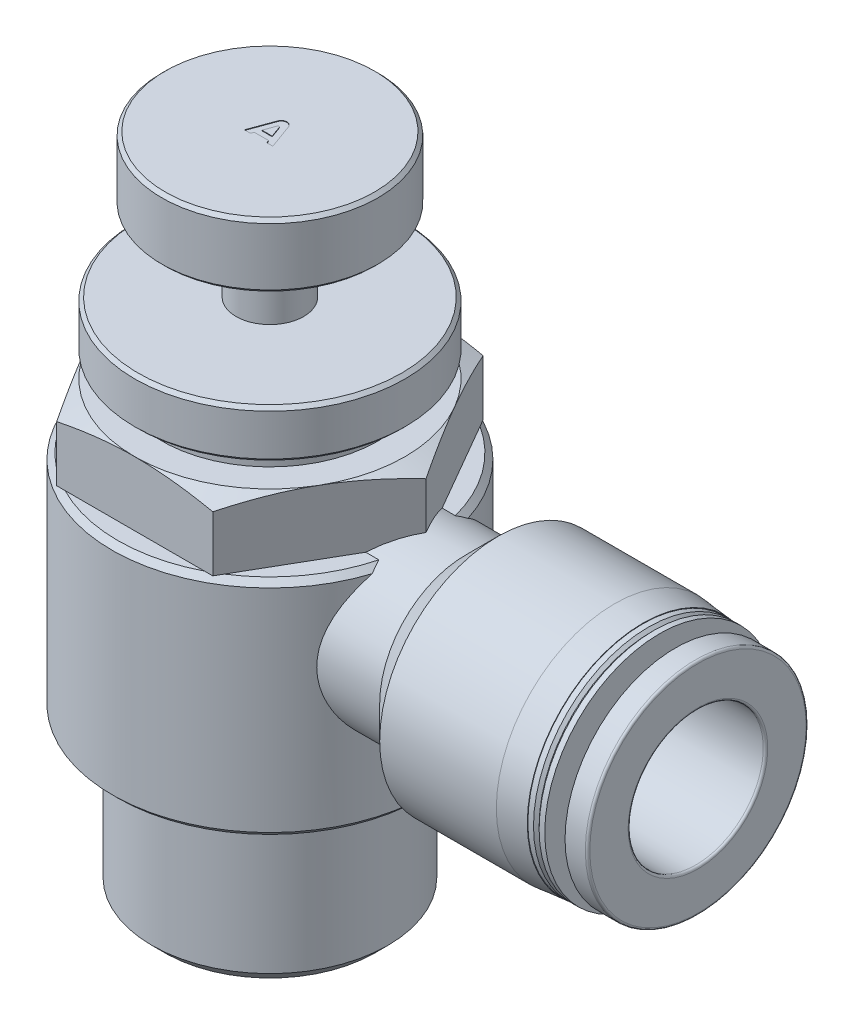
ISO-10303-21;
HEADER;
FILE_DESCRIPTION(('STEP AP214'),'2;1');
FILE_NAME('part.step','',(''),(''),'','','');
FILE_SCHEMA(('AUTOMOTIVE_DESIGN { 1 0 10303 214 1 1 1 1 }'));
ENDSEC;
DATA;
#1=APPLICATION_CONTEXT('core data for automotive mechanical design processes');
#2=APPLICATION_PROTOCOL_DEFINITION('international standard','automotive_design',2000,#1);
#3=PRODUCT_CONTEXT('',#1,'mechanical');
#4=PRODUCT('Part','Part','',(#3));
#5=PRODUCT_RELATED_PRODUCT_CATEGORY('part','',(#4));
#6=PRODUCT_DEFINITION_FORMATION('','',#4);
#7=PRODUCT_DEFINITION_CONTEXT('part definition',#1,'design');
#8=PRODUCT_DEFINITION('design','',#6,#7);
#9=PRODUCT_DEFINITION_SHAPE('','',#8);
#10=(LENGTH_UNIT() NAMED_UNIT(*) SI_UNIT(.MILLI.,.METRE.));
#11=(NAMED_UNIT(*) PLANE_ANGLE_UNIT() SI_UNIT($,.RADIAN.));
#12=(NAMED_UNIT(*) SI_UNIT($,.STERADIAN.) SOLID_ANGLE_UNIT());
#13=UNCERTAINTY_MEASURE_WITH_UNIT(LENGTH_MEASURE(1.E-05),#10,'distance_accuracy_value','');
#14=(GEOMETRIC_REPRESENTATION_CONTEXT(3) GLOBAL_UNCERTAINTY_ASSIGNED_CONTEXT((#13)) GLOBAL_UNIT_ASSIGNED_CONTEXT((#10,
#11,#12)) REPRESENTATION_CONTEXT('',''));
#15=CARTESIAN_POINT('',(0.,0.,0.));
#16=DIRECTION('',(0.,0.,1.));
#17=DIRECTION('',(1.,0.,0.));
#18=AXIS2_PLACEMENT_3D('',#15,#16,#17);
#19=CARTESIAN_POINT('',(0.,3.4925,0.));
#20=DIRECTION('',(0.,-1.,0.));
#21=DIRECTION('',(-1.,0.,0.));
#22=AXIS2_PLACEMENT_3D('',#19,#20,#21);
#23=SPHERICAL_SURFACE('',#22,3.4925);
#24=CARTESIAN_POINT('',(0.,3.49250000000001,0.));
#25=DIRECTION('',(0.,-1.,0.));
#26=DIRECTION('',(0.,0.,-1.));
#27=AXIS2_PLACEMENT_3D('',#24,#25,#26);
#28=CIRCLE('',#27,3.4925);
#29=CARTESIAN_POINT('',(2.89743205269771,3.4925,1.94998557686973));
#30=VERTEX_POINT('',#29);
#31=CARTESIAN_POINT('',(2.8974320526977,3.49250000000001,-1.94998557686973));
#32=VERTEX_POINT('',#31);
#33=EDGE_CURVE('E430',#30,#32,#28,.T.);
#34=ORIENTED_EDGE('',*,*,#33,.T.);
#35=CARTESIAN_POINT('',(2.89719096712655,3.49229999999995,-1.95034374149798));
#36=CARTESIAN_POINT('',(2.93982640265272,3.52767428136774,-1.88702498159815));
#37=CARTESIAN_POINT('',(2.98021808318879,3.56195588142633,-1.82157135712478));
#38=CARTESIAN_POINT('',(3.0563799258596,3.62777321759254,-1.68667542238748));
#39=CARTESIAN_POINT('',(3.09214822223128,3.65930784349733,-1.61723151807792));
#40=CARTESIAN_POINT('',(3.15896422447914,3.71910352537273,-1.47453912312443));
#41=CARTESIAN_POINT('',(3.19000194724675,3.74735762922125,-1.401283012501));
#42=CARTESIAN_POINT('',(3.2471132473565,3.79999040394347,-1.2515527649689));
#43=CARTESIAN_POINT('',(3.27318753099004,3.82436962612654,-1.17507908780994));
#44=CARTESIAN_POINT('',(3.34389820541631,3.89110828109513,-0.941029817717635));
#45=CARTESIAN_POINT('',(3.38088650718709,3.92694414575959,-0.779117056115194));
#46=CARTESIAN_POINT('',(3.43345231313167,3.97822504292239,-0.449011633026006));
#47=CARTESIAN_POINT('',(3.44906186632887,3.99370059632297,-0.280828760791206));
#48=CARTESIAN_POINT('',(3.45840703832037,4.00294407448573,0.0490239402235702));
#49=CARTESIAN_POINT('',(3.45311077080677,3.99767278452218,0.210639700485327));
#50=CARTESIAN_POINT('',(3.42290648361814,3.96794019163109,0.530312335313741));
#51=CARTESIAN_POINT('',(3.3979874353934,3.94346809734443,0.688367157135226));
#52=CARTESIAN_POINT('',(3.32951136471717,3.87752257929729,0.994519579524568));
#53=CARTESIAN_POINT('',(3.28618369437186,3.83625862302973,1.14271458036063));
#54=CARTESIAN_POINT('',(3.18176224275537,3.73956991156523,1.42765933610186));
#55=CARTESIAN_POINT('',(3.12068450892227,3.68415795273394,1.56441928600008));
#56=CARTESIAN_POINT('',(3.02752808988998,3.60277253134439,1.73852138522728));
#57=CARTESIAN_POINT('',(3.0027718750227,3.58138554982,1.78213196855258));
#58=CARTESIAN_POINT('',(2.9513865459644,3.53758384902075,1.86756318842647));
#59=CARTESIAN_POINT('',(2.92476122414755,3.51517124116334,1.90938718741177));
#60=CARTESIAN_POINT('',(2.89719096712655,3.49229999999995,1.95034374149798));
#61=B_SPLINE_CURVE_WITH_KNOTS('',3,(#35,#36,#37,#38,#39,#40,#41,#42,#43,#44,#45,#46,#47,#48,#49,
#50,#51,#52,#53,#54,#55,#56,#57,#58,#59,#60),.UNSPECIFIED.,.F.,.F.,(4,2,2,2,2,2,2,2,2,2,2,2,4),
(0.,0.252350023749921,0.504801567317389,0.757778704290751,1.01071981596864,1.51762240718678,
2.02376426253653,2.50674881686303,2.99000501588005,3.46740918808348,3.94438308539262,
4.10788556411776,4.27106538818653),.UNSPECIFIED.);
#62=EDGE_CURVE('E381',#32,#30,#61,.T.);
#63=ORIENTED_EDGE('',*,*,#62,.T.);
#64=EDGE_LOOP('',(#34,#63));
#65=FACE_BOUND('',#64,.T.);
#66=ADVANCED_FACE('F39',(#65),#23,.F.);
#67=CARTESIAN_POINT('',(0.,6.985,0.));
#68=DIRECTION('',(0.,-1.,0.));
#69=DIRECTION('',(0.,0.,-1.));
#70=AXIS2_PLACEMENT_3D('',#67,#68,#69);
#71=CYLINDRICAL_SURFACE('',#70,3.4925);
#72=CARTESIAN_POINT('',(2.8974320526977,3.49250000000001,1.94998557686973));
#73=CARTESIAN_POINT('',(2.83537704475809,3.44104448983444,2.04215425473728));
#74=CARTESIAN_POINT('',(2.76967517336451,3.38702833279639,2.13032112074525));
#75=CARTESIAN_POINT('',(2.63171902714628,3.27516608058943,2.29858005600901));
#76=CARTESIAN_POINT('',(2.55947124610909,3.21732379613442,2.37867996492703));
#77=CARTESIAN_POINT('',(2.40795249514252,3.09813924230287,2.53201536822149));
#78=CARTESIAN_POINT('',(2.32859507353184,3.03675845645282,2.60513484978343));
#79=CARTESIAN_POINT('',(2.16414129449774,2.91256546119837,2.74328032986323));
#80=CARTESIAN_POINT('',(2.07904390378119,2.84975299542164,2.80830486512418));
#81=CARTESIAN_POINT('',(1.90360504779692,2.7244077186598,2.93005138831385));
#82=CARTESIAN_POINT('',(1.81328641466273,2.66187481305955,2.98680619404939));
#83=CARTESIAN_POINT('',(1.62684904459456,2.53853930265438,3.09231323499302));
#84=CARTESIAN_POINT('',(1.53072677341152,2.47773778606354,3.14106052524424));
#85=CARTESIAN_POINT('',(1.33288469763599,2.36065508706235,3.22996409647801));
#86=CARTESIAN_POINT('',(1.23120493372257,2.30434731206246,3.27017368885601));
#87=CARTESIAN_POINT('',(1.0211461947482,2.19930238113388,3.3417201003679));
#88=CARTESIAN_POINT('',(0.912780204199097,2.15055115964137,3.37307349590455));
#89=CARTESIAN_POINT('',(0.699548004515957,2.06955270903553,3.42330380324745));
#90=CARTESIAN_POINT('',(0.595341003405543,2.03617184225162,3.44308819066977));
#91=CARTESIAN_POINT('',(0.382171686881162,1.98443811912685,3.47317489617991));
#92=CARTESIAN_POINT('',(0.273235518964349,1.9660115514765,3.48352375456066));
#93=CARTESIAN_POINT('',(0.136283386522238,1.95455036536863,3.48994737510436));
#94=CARTESIAN_POINT('',(0.109085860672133,1.95284317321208,3.4909028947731));
#95=CARTESIAN_POINT('',(0.0545953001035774,1.95056130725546,3.49217905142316));
#96=CARTESIAN_POINT('',(0.0273021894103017,1.94998801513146,3.49249891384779));
#97=CARTESIAN_POINT('',(0.,1.94998557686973,3.4925));
#98=B_SPLINE_CURVE_WITH_KNOTS('',3,(#72,#73,#74,#75,#76,#77,#78,#79,#80,#81,#82,#83,#84,#85,#86,
#87,#88,#89,#90,#91,#92,#93,#94,#95,#96,#97),.UNSPECIFIED.,.F.,.F.,(4,2,2,2,2,2,2,2,2,2,2,2,4),
(0.,0.367071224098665,0.733782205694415,1.10579603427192,1.47787701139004,1.84843866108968,
2.21922829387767,2.5876297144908,2.95533694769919,3.28781904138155,3.61865216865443,
3.70043337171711,3.78231416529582),.UNSPECIFIED.);
#99=CARTESIAN_POINT('',(0.,1.94998557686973,3.4925));
#100=VERTEX_POINT('',#99);
#101=EDGE_CURVE('E406',#30,#100,#98,.T.);
#102=ORIENTED_EDGE('',*,*,#101,.T.);
#103=DIRECTION('',(0.,-1.,0.));
#104=VECTOR('',#103,1.);
#105=CARTESIAN_POINT('',(0.,6.985,3.4925));
#106=LINE('',#105,#104);
#107=CARTESIAN_POINT('',(0.,0.,3.49250000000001));
#108=VERTEX_POINT('',#107);
#109=EDGE_CURVE('E412',#100,#108,#106,.T.);
#110=ORIENTED_EDGE('',*,*,#109,.T.);
#111=CARTESIAN_POINT('',(0.,0.,0.));
#112=DIRECTION('',(0.,-1.,0.));
#113=DIRECTION('',(0.,0.,-1.));
#114=AXIS2_PLACEMENT_3D('',#111,#112,#113);
#115=CIRCLE('',#114,3.49250000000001);
#116=CARTESIAN_POINT('',(0.,0.,-3.49250000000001));
#117=VERTEX_POINT('',#116);
#118=EDGE_CURVE('E427',#108,#117,#115,.T.);
#119=ORIENTED_EDGE('',*,*,#118,.T.);
#120=DIRECTION('',(0.,-1.,0.));
#121=VECTOR('',#120,1.);
#122=CARTESIAN_POINT('',(0.,6.985,-3.4925));
#123=LINE('',#122,#121);
#124=CARTESIAN_POINT('',(0.,1.94998557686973,-3.4925));
#125=VERTEX_POINT('',#124);
#126=EDGE_CURVE('E415',#117,#125,#123,.F.);
#127=ORIENTED_EDGE('',*,*,#126,.T.);
#128=CARTESIAN_POINT('',(0.,1.94998557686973,-3.4925));
#129=CARTESIAN_POINT('',(0.0571445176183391,1.94993672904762,-3.49251400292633));
#130=CARTESIAN_POINT('',(0.114256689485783,1.95249635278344,-3.49109816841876));
#131=CARTESIAN_POINT('',(0.22779570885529,1.96244612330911,-3.48552173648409));
#132=CARTESIAN_POINT('',(0.2842238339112,1.96982510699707,-3.481367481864));
#133=CARTESIAN_POINT('',(0.395093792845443,1.98886750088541,-3.4705209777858));
#134=CARTESIAN_POINT('',(0.449553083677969,2.00045609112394,-3.46387298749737));
#135=CARTESIAN_POINT('',(0.557211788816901,2.02736596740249,-3.44819251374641));
#136=CARTESIAN_POINT('',(0.610410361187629,2.04268967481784,-3.43915848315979));
#137=CARTESIAN_POINT('',(0.739014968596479,2.08407875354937,-3.41429739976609));
#138=CARTESIAN_POINT('',(0.81362799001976,2.11187319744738,-3.39724359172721));
#139=CARTESIAN_POINT('',(0.959698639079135,2.17233762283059,-3.35890454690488));
#140=CARTESIAN_POINT('',(1.0311547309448,2.20500994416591,-3.33761727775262));
#141=CARTESIAN_POINT('',(1.24236655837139,2.30882471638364,-3.26745752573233));
#142=CARTESIAN_POINT('',(1.37755219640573,2.38525339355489,-3.2125734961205));
#143=CARTESIAN_POINT('',(1.60986172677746,2.52737336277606,-3.10141933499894));
#144=CARTESIAN_POINT('',(1.70902597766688,2.59195938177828,-3.04784878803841));
#145=CARTESIAN_POINT('',(1.90120159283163,2.72250372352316,-2.93182360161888));
#146=CARTESIAN_POINT('',(1.99420916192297,2.78846286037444,-2.8693635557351));
#147=CARTESIAN_POINT('',(2.17361308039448,2.9194717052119,-2.73594491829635));
#148=CARTESIAN_POINT('',(2.2600403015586,2.9845243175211,-2.66503060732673));
#149=CARTESIAN_POINT('',(2.42653411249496,3.1125040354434,-2.51437527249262));
#150=CARTESIAN_POINT('',(2.50660243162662,3.17543171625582,-2.43463666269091));
#151=CARTESIAN_POINT('',(2.63953814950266,3.28153252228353,-2.28853695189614));
#152=CARTESIAN_POINT('',(2.69399790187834,3.32552767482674,-2.22421734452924));
#153=CARTESIAN_POINT('',(2.79885551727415,3.41103032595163,-2.0907318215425));
#154=CARTESIAN_POINT('',(2.84925128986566,3.45253654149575,-2.02156344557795));
#155=CARTESIAN_POINT('',(2.89743205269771,3.4925,-1.94998557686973));
#156=B_SPLINE_CURVE_WITH_KNOTS('',3,(#128,#129,#130,#131,#132,#133,#134,#135,#136,#137,#138,
#139,#140,#141,#142,#143,#144,#145,#146,#147,#148,#149,#150,#151,#152,#153,#154,#155),
.UNSPECIFIED.,.F.,.F.,(4,2,2,2,2,2,2,2,2,2,2,2,2,4),(0.,0.17130705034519,0.342218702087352,
0.510230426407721,0.678351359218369,0.922216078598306,1.16619815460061,1.65870395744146,
2.04802328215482,2.43758040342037,2.82518007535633,3.21267397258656,3.49765809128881,
3.78278787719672),.UNSPECIFIED.);
#157=EDGE_CURVE('E373',#125,#32,#156,.T.);
#158=ORIENTED_EDGE('',*,*,#157,.T.);
#159=ORIENTED_EDGE('',*,*,#33,.F.);
#160=EDGE_LOOP('',(#102,#110,#119,#127,#158,#159));
#161=FACE_BOUND('',#160,.T.);
#162=ADVANCED_FACE('F387',(#161),#71,.F.);
#163=CARTESIAN_POINT('',(-5.23875,0.,0.));
#164=DIRECTION('',(0.,-1.,0.));
#165=DIRECTION('',(0.,0.,-1.));
#166=AXIS2_PLACEMENT_3D('',#163,#164,#165);
#167=PLANE('',#166);
#168=ORIENTED_EDGE('',*,*,#118,.F.);
#169=DIRECTION('',(0.,0.,1.));
#170=VECTOR('',#169,1.);
#171=CARTESIAN_POINT('',(0.,0.,0.));
#172=LINE('',#171,#170);
#173=CARTESIAN_POINT('',(0.,0.,4.));
#174=VERTEX_POINT('',#173);
#175=EDGE_CURVE('E11',#108,#174,#172,.T.);
#176=ORIENTED_EDGE('',*,*,#175,.T.);
#177=DIRECTION('',(-1.,0.,0.));
#178=VECTOR('',#177,1.);
#179=CARTESIAN_POINT('',(38.,0.,4.));
#180=LINE('',#179,#178);
#181=CARTESIAN_POINT('',(3.38297229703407,0.,4.));
#182=VERTEX_POINT('',#181);
#183=EDGE_CURVE('E370',#174,#182,#180,.F.);
#184=ORIENTED_EDGE('',*,*,#183,.T.);
#185=CARTESIAN_POINT('',(0.,0.,0.));
#186=DIRECTION('',(0.,-1.,0.));
#187=DIRECTION('',(0.,0.,-1.));
#188=AXIS2_PLACEMENT_3D('',#185,#186,#187);
#189=CIRCLE('',#188,5.23875);
#190=CARTESIAN_POINT('',(3.38297229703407,0.,-4.));
#191=VERTEX_POINT('',#190);
#192=EDGE_CURVE('E424',#182,#191,#189,.T.);
#193=ORIENTED_EDGE('',*,*,#192,.T.);
#194=DIRECTION('',(-1.,0.,0.));
#195=VECTOR('',#194,1.);
#196=CARTESIAN_POINT('',(38.,0.,-4.));
#197=LINE('',#196,#195);
#198=CARTESIAN_POINT('',(0.,0.,-4.));
#199=VERTEX_POINT('',#198);
#200=EDGE_CURVE('E367',#191,#199,#197,.T.);
#201=ORIENTED_EDGE('',*,*,#200,.T.);
#202=EDGE_CURVE('E43',#199,#117,#172,.T.);
#203=ORIENTED_EDGE('',*,*,#202,.T.);
#204=EDGE_LOOP('',(#168,#176,#184,#193,#201,#203));
#205=FACE_BOUND('',#204,.T.);
#206=ADVANCED_FACE('F684',(#205),#167,.T.);
#207=CARTESIAN_POINT('',(0.,6.985,0.));
#208=DIRECTION('',(0.,-1.,0.));
#209=DIRECTION('',(0.,0.,-1.));
#210=AXIS2_PLACEMENT_3D('',#207,#208,#209);
#211=CYLINDRICAL_SURFACE('',#210,5.23875);
#212=CARTESIAN_POINT('',(0.,-26.7,0.));
#213=DIRECTION('',(0.,-1.,0.));
#214=DIRECTION('',(0.,0.,-1.));
#215=AXIS2_PLACEMENT_3D('',#212,#213,#214);
#216=CIRCLE('',#215,5.23875);
#217=CARTESIAN_POINT('',(0.,-26.7,-5.23875));
#218=VERTEX_POINT('',#217);
#219=EDGE_CURVE('E421',#218,#218,#216,.T.);
#220=ORIENTED_EDGE('',*,*,#219,.T.);
#221=EDGE_LOOP('',(#220));
#222=FACE_BOUND('',#221,.T.);
#223=ORIENTED_EDGE('',*,*,#192,.F.);
#224=CARTESIAN_POINT('',(3.38297229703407,0.,4.));
#225=CARTESIAN_POINT('',(3.38289135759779,-0.0936091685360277,4.00003193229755));
#226=CARTESIAN_POINT('',(3.38685565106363,-0.187162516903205,3.99671567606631));
#227=CARTESIAN_POINT('',(3.4022363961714,-0.372985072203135,3.98364992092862));
#228=CARTESIAN_POINT('',(3.41363507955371,-0.465256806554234,3.97391576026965));
#229=CARTESIAN_POINT('',(3.44304157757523,-0.646502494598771,3.94845713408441));
#230=CARTESIAN_POINT('',(3.46095324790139,-0.735504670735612,3.93281969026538));
#231=CARTESIAN_POINT('',(3.50245332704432,-0.911014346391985,3.89590786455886));
#232=CARTESIAN_POINT('',(3.52604538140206,-0.997520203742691,3.87462986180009));
#233=CARTESIAN_POINT('',(3.58351917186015,-1.18610429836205,3.82161296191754));
#234=CARTESIAN_POINT('',(3.61852285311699,-1.2874831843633,3.78860572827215));
#235=CARTESIAN_POINT('',(3.69365581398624,-1.48559283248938,3.71539649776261));
#236=CARTESIAN_POINT('',(3.73378613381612,-1.58232264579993,3.67519304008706));
#237=CARTESIAN_POINT('',(3.85994523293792,-1.86647201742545,3.54400974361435));
#238=CARTESIAN_POINT('',(3.95139831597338,-2.04682544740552,3.44275401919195));
#239=CARTESIAN_POINT('',(4.1407114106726,-2.39212050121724,3.21275359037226));
#240=CARTESIAN_POINT('',(4.23866939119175,-2.55662291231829,3.08344053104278));
#241=CARTESIAN_POINT('',(4.43110220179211,-2.86434872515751,2.79984655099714));
#242=CARTESIAN_POINT('',(4.5255829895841,-3.00760993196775,2.64561103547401));
#243=CARTESIAN_POINT('',(4.70062116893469,-3.26493790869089,2.31979166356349));
#244=CARTESIAN_POINT('',(4.78159645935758,-3.37997750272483,2.1492073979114));
#245=CARTESIAN_POINT('',(4.9283022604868,-3.58451292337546,1.78727241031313));
#246=CARTESIAN_POINT('',(4.99404387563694,-3.67402736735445,1.59593696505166));
#247=CARTESIAN_POINT('',(5.09633353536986,-3.81181062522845,1.22598449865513));
#248=CARTESIAN_POINT('',(5.13577322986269,-3.8642397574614,1.04972645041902));
#249=CARTESIAN_POINT('',(5.196501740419,-3.94459496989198,0.688692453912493));
#250=CARTESIAN_POINT('',(5.21780264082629,-3.97253736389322,0.503922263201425));
#251=CARTESIAN_POINT('',(5.24047094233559,-4.00226546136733,0.130522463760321));
#252=CARTESIAN_POINT('',(5.24178290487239,-4.00397841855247,-0.0581164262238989));
#253=CARTESIAN_POINT('',(5.22420913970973,-3.98094382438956,-0.43281817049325));
#254=CARTESIAN_POINT('',(5.20532021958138,-3.95619209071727,-0.61888061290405));
#255=CARTESIAN_POINT('',(5.15017030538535,-3.88333464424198,-0.975445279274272));
#256=CARTESIAN_POINT('',(5.11465439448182,-3.83622949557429,-1.14627271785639));
#257=CARTESIAN_POINT('',(5.0291428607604,-3.72145642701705,-1.47696640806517));
#258=CARTESIAN_POINT('',(4.97914366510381,-3.65378343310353,-1.63682994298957));
#259=CARTESIAN_POINT('',(4.86181444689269,-3.49229830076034,-1.95953609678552));
#260=CARTESIAN_POINT('',(4.79320979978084,-3.3964769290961,-2.12090126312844));
#261=CARTESIAN_POINT('',(4.64634512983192,-3.18586239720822,-2.42583482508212));
#262=CARTESIAN_POINT('',(4.56807882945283,-3.07105688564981,-2.56939152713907));
#263=CARTESIAN_POINT('',(4.39006350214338,-2.80011687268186,-2.86482058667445));
#264=CARTESIAN_POINT('',(4.28914750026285,-2.64030828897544,-3.0126192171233));
#265=CARTESIAN_POINT('',(4.0876143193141,-2.29853090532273,-3.28085896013));
#266=CARTESIAN_POINT('',(3.98699774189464,-2.1165319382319,-3.40126217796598));
#267=CARTESIAN_POINT('',(3.81332830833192,-1.76521478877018,-3.59398962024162));
#268=CARTESIAN_POINT('',(3.73854860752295,-1.59935213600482,-3.6710515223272));
#269=CARTESIAN_POINT('',(3.60435760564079,-1.25376338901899,-3.80288549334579));
#270=CARTESIAN_POINT('',(3.54486537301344,-1.07411712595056,-3.8577758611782));
#271=CARTESIAN_POINT('',(3.47967485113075,-0.817540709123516,-3.91624242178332));
#272=CARTESIAN_POINT('',(3.46343326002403,-0.745621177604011,-3.93058370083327));
#273=CARTESIAN_POINT('',(3.43508524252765,-0.60031762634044,-3.95538160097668));
#274=CARTESIAN_POINT('',(3.42297727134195,-0.526934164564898,-3.96583967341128));
#275=CARTESIAN_POINT('',(3.40325642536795,-0.378306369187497,-3.98277907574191));
#276=CARTESIAN_POINT('',(3.3956922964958,-0.303050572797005,-3.989217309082));
#277=CARTESIAN_POINT('',(3.38552879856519,-0.151870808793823,-3.99783763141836));
#278=CARTESIAN_POINT('',(3.38293563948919,-0.0759461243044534,-4.0000143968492));
#279=CARTESIAN_POINT('',(3.38297229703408,0.,-4.));
#280=B_SPLINE_CURVE_WITH_KNOTS('',3,(#224,#225,#226,#227,#228,#229,#230,#231,#232,#233,#234,
#235,#236,#237,#238,#239,#240,#241,#242,#243,#244,#245,#246,#247,#248,#249,#250,#251,#252,#253,
#254,#255,#256,#257,#258,#259,#260,#261,#262,#263,#264,#265,#266,#267,#268,#269,#270,#271,#272,
#273,#274,#275,#276,#277,#278,#279),.UNSPECIFIED.,.F.,.F.,(4,2,2,2,2,2,2,2,2,2,2,2,2,2,2,2,2,2,
2,2,2,2,2,2,2,2,2,4),(0.,0.28059593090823,0.560523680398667,0.836476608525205,1.11260711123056,
1.44872176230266,1.78490472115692,2.46059614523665,3.15152344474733,3.84120587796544,
4.50194693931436,5.16220483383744,5.72399225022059,6.28540510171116,6.84837472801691,
7.41143333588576,7.95137452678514,8.49144902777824,9.08871913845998,9.68637938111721,
10.4035058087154,11.1216182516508,11.7126500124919,12.3004852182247,12.5256404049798,
12.7507113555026,12.9781556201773,13.2058838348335),.UNSPECIFIED.);
#281=EDGE_CURVE('E399',#182,#191,#280,.T.);
#282=ORIENTED_EDGE('',*,*,#281,.T.);
#283=EDGE_LOOP('',(#223,#282));
#284=FACE_BOUND('',#283,.T.);
#285=ADVANCED_FACE('F607',(#222,#284),#211,.F.);
#286=CARTESIAN_POINT('',(0.,6.8,0.));
#287=DIRECTION('',(0.,1.,0.));
#288=DIRECTION('',(0.,0.,1.));
#289=AXIS2_PLACEMENT_3D('',#286,#287,#288);
#290=PLANE('',#289);
#291=CARTESIAN_POINT('',(0.,6.8,0.));
#292=DIRECTION('',(0.,-1.,0.));
#293=DIRECTION('',(1.,0.,0.));
#294=AXIS2_PLACEMENT_3D('',#291,#292,#293);
#295=CIRCLE('',#294,13.5);
#296=CARTESIAN_POINT('',(13.0663690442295,6.8,3.39411254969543));
#297=VERTEX_POINT('',#296);
#298=CARTESIAN_POINT('',(7.29997562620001,6.8,11.3560713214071));
#299=VERTEX_POINT('',#298);
#300=EDGE_CURVE('E1577',#297,#299,#295,.T.);
#301=ORIENTED_EDGE('',*,*,#300,.F.);
#302=DIRECTION('',(-1.,0.,0.));
#303=VECTOR('',#302,1.);
#304=CARTESIAN_POINT('',(38.,6.8,3.39411254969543));
#305=LINE('',#304,#303);
#306=CARTESIAN_POINT('',(11.8968146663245,6.8,3.39411254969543));
#307=VERTEX_POINT('',#306);
#308=EDGE_CURVE('E1658',#297,#307,#305,.T.);
#309=ORIENTED_EDGE('',*,*,#308,.T.);
#310=DIRECTION('',(0.5,0.,-0.866025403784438));
#311=VECTOR('',#310,1.);
#312=CARTESIAN_POINT('',(6.9282032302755,6.8,12.));
#313=LINE('',#312,#311);
#314=EDGE_CURVE('E1512',#299,#307,#313,.T.);
#315=ORIENTED_EDGE('',*,*,#314,.F.);
#316=EDGE_LOOP('',(#301,#309,#315));
#317=FACE_BOUND('',#316,.T.);
#318=ADVANCED_FACE('F603',(#317),#290,.T.);
#319=DIRECTION('',(-0.5,0.,-0.866025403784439));
#320=VECTOR('',#319,1.);
#321=CARTESIAN_POINT('',(13.856406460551,6.8,0.));
#322=LINE('',#321,#320);
#323=CARTESIAN_POINT('',(11.8968146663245,6.8,-3.39411254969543));
#324=VERTEX_POINT('',#323);
#325=CARTESIAN_POINT('',(7.29997562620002,6.8,-11.3560713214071));
#326=VERTEX_POINT('',#325);
#327=EDGE_CURVE('E1515',#324,#326,#322,.T.);
#328=ORIENTED_EDGE('',*,*,#327,.F.);
#329=DIRECTION('',(-1.,0.,0.));
#330=VECTOR('',#329,1.);
#331=CARTESIAN_POINT('',(38.,6.8,-3.39411254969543));
#332=LINE('',#331,#330);
#333=CARTESIAN_POINT('',(13.0663690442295,6.8,-3.39411254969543));
#334=VERTEX_POINT('',#333);
#335=EDGE_CURVE('E495',#324,#334,#332,.F.);
#336=ORIENTED_EDGE('',*,*,#335,.T.);
#337=CARTESIAN_POINT('',(0.,6.8,0.));
#338=DIRECTION('',(0.,1.,0.));
#339=DIRECTION('',(0.,0.,1.));
#340=AXIS2_PLACEMENT_3D('',#337,#338,#339);
#341=CIRCLE('',#340,13.5);
#342=EDGE_CURVE('E1628',#334,#326,#341,.T.);
#343=ORIENTED_EDGE('',*,*,#342,.T.);
#344=EDGE_LOOP('',(#328,#336,#343));
#345=FACE_BOUND('',#344,.T.);
#346=ADVANCED_FACE('F606',(#345),#290,.T.);
#347=CARTESIAN_POINT('',(0.,31.5,0.));
#348=DIRECTION('',(0.,-1.,0.));
#349=DIRECTION('',(1.,0.,0.));
#350=AXIS2_PLACEMENT_3D('',#347,#348,#349);
#351=CYLINDRICAL_SURFACE('',#350,14.);
#352=CARTESIAN_POINT('',(0.,-12.5,0.));
#353=DIRECTION('',(0.,-1.,0.));
#354=DIRECTION('',(1.,0.,0.));
#355=AXIS2_PLACEMENT_3D('',#352,#353,#354);
#356=CIRCLE('',#355,14.);
#357=CARTESIAN_POINT('',(14.,-12.5,0.));
#358=VERTEX_POINT('',#357);
#359=EDGE_CURVE('E1665',#358,#358,#356,.T.);
#360=ORIENTED_EDGE('',*,*,#359,.F.);
#361=EDGE_LOOP('',(#360));
#362=FACE_BOUND('',#361,.T.);
#363=CARTESIAN_POINT('',(13.3390404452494,6.3,4.25088226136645));
#364=CARTESIAN_POINT('',(13.2807105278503,6.17645548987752,4.43397615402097));
#365=CARTESIAN_POINT('',(13.2200791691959,6.04529815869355,4.61114765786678));
#366=CARTESIAN_POINT('',(13.0958949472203,5.76869750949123,4.95282151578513));
#367=CARTESIAN_POINT('',(13.0323425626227,5.62325652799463,5.11732593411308));
#368=CARTESIAN_POINT('',(12.9036873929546,5.31829957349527,5.43361483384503));
#369=CARTESIAN_POINT('',(12.8385788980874,5.15872294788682,5.58533845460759));
#370=CARTESIAN_POINT('',(12.7088752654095,4.82688741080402,5.87448640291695));
#371=CARTESIAN_POINT('',(12.6442801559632,4.65462780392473,6.01190994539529));
#372=CARTESIAN_POINT('',(12.5174376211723,4.29813944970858,6.27173603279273));
#373=CARTESIAN_POINT('',(12.4551915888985,4.11390377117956,6.39412975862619));
#374=CARTESIAN_POINT('',(12.335052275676,3.73442030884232,6.62292863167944));
#375=CARTESIAN_POINT('',(12.2771585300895,3.53917370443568,6.72933548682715));
#376=CARTESIAN_POINT('',(12.1678150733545,3.13890495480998,6.92508744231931));
#377=CARTESIAN_POINT('',(12.1163566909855,2.93389648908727,7.01445558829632));
#378=CARTESIAN_POINT('',(12.0218461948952,2.51521707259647,7.17522944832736));
#379=CARTESIAN_POINT('',(11.9787882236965,2.30155228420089,7.24664768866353));
#380=CARTESIAN_POINT('',(11.9051630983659,1.87975001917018,7.36693799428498));
#381=CARTESIAN_POINT('',(11.8740119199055,1.67202215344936,7.41688586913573));
#382=CARTESIAN_POINT('',(11.8221662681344,1.25182132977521,7.49925100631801));
#383=CARTESIAN_POINT('',(11.8014712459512,1.03934862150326,7.53166918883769));
#384=CARTESIAN_POINT('',(11.7715285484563,0.611808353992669,7.57838311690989));
#385=CARTESIAN_POINT('',(11.7622704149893,0.396743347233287,7.59269541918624));
#386=CARTESIAN_POINT('',(11.755628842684,-0.033996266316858,7.60297549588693));
#387=CARTESIAN_POINT('',(11.7582439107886,-0.249670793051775,7.5989455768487));
#388=CARTESIAN_POINT('',(11.7739612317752,-0.647910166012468,7.5745620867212));
#389=CARTESIAN_POINT('',(11.7854710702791,-0.830696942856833,7.55668629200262));
#390=CARTESIAN_POINT('',(11.8166241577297,-1.19387687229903,7.50787811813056));
#391=CARTESIAN_POINT('',(11.8362700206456,-1.37426923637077,7.47694154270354));
#392=CARTESIAN_POINT('',(11.8830303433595,-1.73140456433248,7.4023995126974));
#393=CARTESIAN_POINT('',(11.9101443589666,-1.90814774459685,7.35879481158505));
#394=CARTESIAN_POINT('',(11.9709984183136,-2.25706297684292,7.25937948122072));
#395=CARTESIAN_POINT('',(12.0047411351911,-2.42923315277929,7.20356392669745));
#396=CARTESIAN_POINT('',(12.0787516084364,-2.77217424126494,7.07878111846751));
#397=CARTESIAN_POINT('',(12.1191568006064,-2.94281186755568,7.00952979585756));
#398=CARTESIAN_POINT('',(12.204788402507,-3.2776632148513,6.85934505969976));
#399=CARTESIAN_POINT('',(12.250016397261,-3.44187479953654,6.77840780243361));
#400=CARTESIAN_POINT('',(12.3441687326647,-3.76325824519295,6.60539053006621));
#401=CARTESIAN_POINT('',(12.3930936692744,-3.9204289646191,6.51330871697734));
#402=CARTESIAN_POINT('',(12.4935087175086,-4.22714603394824,6.31856650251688));
#403=CARTESIAN_POINT('',(12.5449989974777,-4.37669188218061,6.21590540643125));
#404=CARTESIAN_POINT('',(12.7177422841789,-4.85789741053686,5.85960780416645));
#405=CARTESIAN_POINT('',(12.8423476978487,-5.17253945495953,5.58378047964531));
#406=CARTESIAN_POINT('',(13.0257382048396,-5.60777618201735,5.13386599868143));
#407=CARTESIAN_POINT('',(13.0863225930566,-5.74681706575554,4.97774564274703));
#408=CARTESIAN_POINT('',(13.2049540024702,-6.01206149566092,4.6539091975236));
#409=CARTESIAN_POINT('',(13.2630006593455,-6.13826320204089,4.48619145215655));
#410=CARTESIAN_POINT('',(13.3786058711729,-6.38432607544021,4.12919773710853));
#411=CARTESIAN_POINT('',(13.4359092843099,-6.50330401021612,3.939229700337));
#412=CARTESIAN_POINT('',(13.5444062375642,-6.72459928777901,3.54826483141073));
#413=CARTESIAN_POINT('',(13.5956025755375,-6.8269242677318,3.3472731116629));
#414=CARTESIAN_POINT('',(13.6903974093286,-7.01380530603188,2.93557695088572));
#415=CARTESIAN_POINT('',(13.733999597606,-7.09837000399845,2.72487729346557));
#416=CARTESIAN_POINT('',(13.8122906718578,-7.24868919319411,2.29527134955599));
#417=CARTESIAN_POINT('',(13.8469807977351,-7.3144463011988,2.07636620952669));
#418=CARTESIAN_POINT('',(13.9035720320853,-7.42099407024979,1.65287602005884));
#419=CARTESIAN_POINT('',(13.9263617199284,-7.46353634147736,1.44884933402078));
#420=CARTESIAN_POINT('',(13.963054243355,-7.53178035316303,1.03720722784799));
#421=CARTESIAN_POINT('',(13.9769576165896,-7.55748311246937,0.829592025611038));
#422=CARTESIAN_POINT('',(13.9954727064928,-7.59167059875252,0.412640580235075));
#423=CARTESIAN_POINT('',(14.0000890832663,-7.6001639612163,0.203305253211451));
#424=CARTESIAN_POINT('',(13.9999083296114,-7.59983127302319,-0.215341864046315));
#425=CARTESIAN_POINT('',(13.9951117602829,-7.59100625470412,-0.424653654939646));
#426=CARTESIAN_POINT('',(13.9771379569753,-7.55781408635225,-0.821791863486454));
#427=CARTESIAN_POINT('',(13.9647914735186,-7.53498695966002,-1.00978729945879));
#428=CARTESIAN_POINT('',(13.9327807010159,-7.47549381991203,-1.38300746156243));
#429=CARTESIAN_POINT('',(13.9131139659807,-7.43882318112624,-1.56823124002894));
#430=CARTESIAN_POINT('',(13.8669226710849,-7.35206710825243,-1.93456256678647));
#431=CARTESIAN_POINT('',(13.840400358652,-7.30198607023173,-2.11567144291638));
#432=CARTESIAN_POINT('',(13.7810725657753,-7.18889956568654,-2.47281779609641));
#433=CARTESIAN_POINT('',(13.7482646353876,-7.12588905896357,-2.6488532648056));
#434=CARTESIAN_POINT('',(13.6761900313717,-6.98583358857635,-2.99909367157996));
#435=CARTESIAN_POINT('',(13.6367844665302,-6.90848182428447,-3.17314735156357));
#436=CARTESIAN_POINT('',(13.5529511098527,-6.74148962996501,-3.5140253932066));
#437=CARTESIAN_POINT('',(13.5085216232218,-6.65184505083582,-3.68084728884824));
#438=CARTESIAN_POINT('',(13.3690537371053,-6.36549466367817,-4.16927115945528));
#439=CARTESIAN_POINT('',(13.2677945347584,-6.15129408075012,-4.47902485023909));
#440=CARTESIAN_POINT('',(13.0448667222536,-5.65534321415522,-5.09411697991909));
#441=CARTESIAN_POINT('',(12.9221794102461,-5.36874272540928,-5.39518028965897));
#442=CARTESIAN_POINT('',(12.7388965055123,-4.90506012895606,-5.8089091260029));
#443=CARTESIAN_POINT('',(12.6778760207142,-4.74472026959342,-5.94060223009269));
#444=CARTESIAN_POINT('',(12.5576050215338,-4.41330918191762,-6.19078254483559));
#445=CARTESIAN_POINT('',(12.4983548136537,-4.24223611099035,-6.30926747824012));
#446=CARTESIAN_POINT('',(12.3791105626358,-3.87739607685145,-6.54031619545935));
#447=CARTESIAN_POINT('',(12.3193716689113,-3.68288238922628,-6.65183485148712));
#448=CARTESIAN_POINT('',(12.2059148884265,-3.28344237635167,-6.85780316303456));
#449=CARTESIAN_POINT('',(12.152194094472,-3.07852114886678,-6.95226107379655));
#450=CARTESIAN_POINT('',(12.0528807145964,-2.65956621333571,-7.12304899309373));
#451=CARTESIAN_POINT('',(12.0072806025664,-2.44554117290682,-7.19939580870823));
#452=CARTESIAN_POINT('',(11.9261619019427,-2.00975568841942,-7.33299318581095));
#453=CARTESIAN_POINT('',(11.8906414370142,-1.78799669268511,-7.39024730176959));
#454=CARTESIAN_POINT('',(11.8343632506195,-1.36102455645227,-7.47999760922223));
#455=CARTESIAN_POINT('',(11.812489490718,-1.15635630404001,-7.51438831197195));
#456=CARTESIAN_POINT('',(11.77927850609,-0.744042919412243,-7.56634385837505));
#457=CARTESIAN_POINT('',(11.7679404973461,-0.536398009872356,-7.58390995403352));
#458=CARTESIAN_POINT('',(11.7563260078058,-0.120195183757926,-7.60190202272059));
#459=CARTESIAN_POINT('',(11.7560421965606,0.088362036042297,-7.60233935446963));
#460=CARTESIAN_POINT('',(11.7665322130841,0.504518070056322,-7.58609351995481));
#461=CARTESIAN_POINT('',(11.7773052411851,0.712116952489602,-7.56941159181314));
#462=CARTESIAN_POINT('',(11.8073347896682,1.09783749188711,-7.52246620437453));
#463=CARTESIAN_POINT('',(11.82531940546,1.27631077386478,-7.49422960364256));
#464=CARTESIAN_POINT('',(11.8686996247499,1.62998201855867,-7.42533681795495));
#465=CARTESIAN_POINT('',(11.8940976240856,1.80517890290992,-7.38467661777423));
#466=CARTESIAN_POINT('',(11.9515151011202,2.15123945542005,-7.29138394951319));
#467=CARTESIAN_POINT('',(11.9835345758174,2.32210312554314,-7.23875148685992));
#468=CARTESIAN_POINT('',(12.05327778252,2.65869484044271,-7.12201630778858));
#469=CARTESIAN_POINT('',(12.0910037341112,2.82442085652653,-7.05790912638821));
#470=CARTESIAN_POINT('',(12.2164572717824,3.33384261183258,-6.84013249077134));
#471=CARTESIAN_POINT('',(12.3125796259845,3.66739217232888,-6.66701386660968));
#472=CARTESIAN_POINT('',(12.516504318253,4.30276527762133,-6.27580616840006));
#473=CARTESIAN_POINT('',(12.6243109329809,4.60457712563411,-6.05770060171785));
#474=CARTESIAN_POINT('',(12.8369490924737,5.15841150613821,-5.59238193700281));
#475=CARTESIAN_POINT('',(12.9416555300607,5.41217971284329,-5.34719766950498));
#476=CARTESIAN_POINT('',(13.0948270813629,5.76591401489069,-4.95432030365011));
#477=CARTESIAN_POINT('',(13.1452160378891,5.87929742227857,-4.81923926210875));
#478=CARTESIAN_POINT('',(13.2439035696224,6.09674673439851,-4.5410153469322));
#479=CARTESIAN_POINT('',(13.2922017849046,6.20081103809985,-4.39787109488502));
#480=CARTESIAN_POINT('',(13.3390404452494,6.3,-4.25088226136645));
#481=B_SPLINE_CURVE_WITH_KNOTS('',3,(#363,#364,#365,#366,#367,#368,#369,#370,#371,#372,#373,
#374,#375,#376,#377,#378,#379,#380,#381,#382,#383,#384,#385,#386,#387,#388,#389,#390,#391,#392,
#393,#394,#395,#396,#397,#398,#399,#400,#401,#402,#403,#404,#405,#406,#407,#408,#409,#410,#411,
#412,#413,#414,#415,#416,#417,#418,#419,#420,#421,#422,#423,#424,#425,#426,#427,#428,#429,#430,
#431,#432,#433,#434,#435,#436,#437,#438,#439,#440,#441,#442,#443,#444,#445,#446,#447,#448,#449,
#450,#451,#452,#453,#454,#455,#456,#457,#458,#459,#460,#461,#462,#463,#464,#465,#466,#467,#468,
#469,#470,#471,#472,#473,#474,#475,#476,#477,#478,#479,#480),.UNSPECIFIED.,.F.,.F.,(4,2,2,2,2,2,
2,2,2,2,2,2,2,2,2,2,2,2,2,2,2,2,2,2,2,2,2,2,2,2,2,2,2,2,2,2,2,2,2,2,2,2,2,2,2,2,2,2,2,2,2,2,2,2,
2,2,2,2,4),(0.,0.685073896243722,1.3700359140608,2.05809423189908,2.74619030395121,
3.43468822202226,4.12311253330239,4.81059900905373,5.4976043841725,6.14435846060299,
6.79107858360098,7.437206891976,8.0832539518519,8.63465990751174,9.18624315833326,
9.73779360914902,10.2895669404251,10.8546132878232,11.419845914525,11.9851698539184,
12.5505309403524,13.8536770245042,14.5061489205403,15.1587141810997,15.8518866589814,
16.544740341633,17.2372561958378,17.9296756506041,18.5577835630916,19.1858534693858,
19.8136081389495,20.4413253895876,21.0099976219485,21.5788600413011,22.147536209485,
22.7164344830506,23.2993112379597,23.8823852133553,25.0479016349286,26.3422887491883,
26.9905705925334,27.6389640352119,28.3341708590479,29.0290403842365,29.7232625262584,
30.4173553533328,31.0424934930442,31.6675851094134,32.2922621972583,32.916894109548,
33.4610450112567,34.0053719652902,34.5496986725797,35.0942376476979,36.2530968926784,
37.4123817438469,38.5130620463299,39.0629436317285,39.6129195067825),.UNSPECIFIED.);
#482=CARTESIAN_POINT('',(13.3390404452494,6.3,4.25088226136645));
#483=VERTEX_POINT('',#482);
#484=CARTESIAN_POINT('',(13.3390404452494,6.3,-4.25088226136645));
#485=VERTEX_POINT('',#484);
#486=EDGE_CURVE('E487',#483,#485,#481,.T.);
#487=ORIENTED_EDGE('',*,*,#486,.F.);
#488=CARTESIAN_POINT('',(0.,6.3,0.));
#489=DIRECTION('',(0.,-1.,0.));
#490=DIRECTION('',(1.,0.,0.));
#491=AXIS2_PLACEMENT_3D('',#488,#489,#490);
#492=CIRCLE('',#491,14.);
#493=EDGE_CURVE('E1662',#483,#485,#492,.T.);
#494=ORIENTED_EDGE('',*,*,#493,.T.);
#495=EDGE_LOOP('',(#487,#494));
#496=FACE_BOUND('',#495,.T.);
#497=ADVANCED_FACE('F497',(#362,#496),#351,.T.);
#498=CARTESIAN_POINT('',(0.,6.8,0.));
#499=DIRECTION('',(0.,-1.,0.));
#500=DIRECTION('',(1.,0.,0.));
#501=AXIS2_PLACEMENT_3D('',#498,#499,#500);
#502=CONICAL_SURFACE('',#501,13.5,0.785398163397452);
#503=CARTESIAN_POINT('',(13.0407959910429,6.8502,3.29161965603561));
#504=CARTESIAN_POINT('',(13.0629475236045,6.80642634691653,3.38272465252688));
#505=CARTESIAN_POINT('',(13.0863484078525,6.76094794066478,3.47270688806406));
#506=CARTESIAN_POINT('',(13.1356626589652,6.66686665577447,3.65005909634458));
#507=CARTESIAN_POINT('',(13.1615705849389,6.61827061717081,3.7374342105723));
#508=CARTESIAN_POINT('',(13.2160065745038,6.51805097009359,3.90959496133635));
#509=CARTESIAN_POINT('',(13.2445346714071,6.46642732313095,3.99438056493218));
#510=CARTESIAN_POINT('',(13.3043121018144,6.36024459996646,4.16138349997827));
#511=CARTESIAN_POINT('',(13.3355670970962,6.30567951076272,4.24359498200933));
#512=CARTESIAN_POINT('',(13.3681756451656,6.2498,4.32434965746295));
#513=B_SPLINE_CURVE_WITH_KNOTS('',3,(#503,#504,#505,#506,#507,#508,#509,#510,#511,#512),
.UNSPECIFIED.,.F.,.F.,(4,2,2,2,4),(0.,0.31039573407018,0.62013232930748,0.929872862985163,
1.24027254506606),.UNSPECIFIED.);
#514=EDGE_CURVE('E518',#297,#483,#513,.T.);
#515=ORIENTED_EDGE('',*,*,#514,.F.);
#516=ORIENTED_EDGE('',*,*,#300,.T.);
#517=CARTESIAN_POINT('',(6.18465843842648,6.8,12.));
#518=VERTEX_POINT('',#517);
#519=EDGE_CURVE('E1508',#299,#518,#295,.T.);
#520=ORIENTED_EDGE('',*,*,#519,.T.);
#521=CARTESIAN_POINT('',(-6.1846584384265,6.8,12.));
#522=VERTEX_POINT('',#521);
#523=EDGE_CURVE('E1629',#522,#518,#341,.T.);
#524=ORIENTED_EDGE('',*,*,#523,.F.);
#525=CARTESIAN_POINT('',(-7.29997562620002,6.8,11.3560713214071));
#526=VERTEX_POINT('',#525);
#527=EDGE_CURVE('E1660',#522,#526,#295,.T.);
#528=ORIENTED_EDGE('',*,*,#527,.T.);
#529=CARTESIAN_POINT('',(-13.4846340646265,6.8,0.643928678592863));
#530=VERTEX_POINT('',#529);
#531=EDGE_CURVE('E1630',#530,#526,#341,.T.);
#532=ORIENTED_EDGE('',*,*,#531,.F.);
#533=CARTESIAN_POINT('',(-13.4846340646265,6.8,-0.643928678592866));
#534=VERTEX_POINT('',#533);
#535=EDGE_CURVE('E1655',#530,#534,#295,.T.);
#536=ORIENTED_EDGE('',*,*,#535,.T.);
#537=CARTESIAN_POINT('',(-7.29997562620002,6.8,-11.3560713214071));
#538=VERTEX_POINT('',#537);
#539=EDGE_CURVE('E1634',#538,#534,#341,.T.);
#540=ORIENTED_EDGE('',*,*,#539,.F.);
#541=CARTESIAN_POINT('',(-6.18465843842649,6.8,-12.));
#542=VERTEX_POINT('',#541);
#543=EDGE_CURVE('E1575',#538,#542,#295,.T.);
#544=ORIENTED_EDGE('',*,*,#543,.T.);
#545=CARTESIAN_POINT('',(6.18465843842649,6.8,-12.));
#546=VERTEX_POINT('',#545);
#547=EDGE_CURVE('E1636',#546,#542,#341,.T.);
#548=ORIENTED_EDGE('',*,*,#547,.F.);
#549=EDGE_CURVE('E1572',#546,#326,#295,.T.);
#550=ORIENTED_EDGE('',*,*,#549,.T.);
#551=ORIENTED_EDGE('',*,*,#342,.F.);
#552=CARTESIAN_POINT('',(13.3681756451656,6.2498,-4.32434965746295));
#553=CARTESIAN_POINT('',(13.3355670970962,6.30567951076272,-4.24359498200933));
#554=CARTESIAN_POINT('',(13.3043121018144,6.36024459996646,-4.16138349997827));
#555=CARTESIAN_POINT('',(13.2445346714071,6.46642732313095,-3.99438056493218));
#556=CARTESIAN_POINT('',(13.2160065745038,6.51805097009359,-3.90959496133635));
#557=CARTESIAN_POINT('',(13.1615705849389,6.61827061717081,-3.7374342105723));
#558=CARTESIAN_POINT('',(13.1356626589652,6.66686665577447,-3.65005909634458));
#559=CARTESIAN_POINT('',(13.0863484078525,6.76094794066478,-3.47270688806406));
#560=CARTESIAN_POINT('',(13.0629475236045,6.80642634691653,-3.38272465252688));
#561=CARTESIAN_POINT('',(13.0407959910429,6.8502,-3.29161965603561));
#562=B_SPLINE_CURVE_WITH_KNOTS('',3,(#552,#553,#554,#555,#556,#557,#558,#559,#560,#561),
.UNSPECIFIED.,.F.,.F.,(4,2,2,2,4),(0.,0.310399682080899,0.620140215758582,0.929876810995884,
1.24027254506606),.UNSPECIFIED.);
#563=EDGE_CURVE('E513',#485,#334,#562,.T.);
#564=ORIENTED_EDGE('',*,*,#563,.F.);
#565=ORIENTED_EDGE('',*,*,#493,.F.);
#566=EDGE_LOOP('',(#515,#516,#520,#524,#528,#532,#536,#540,#544,#548,#550,#551,#564,#565));
#567=FACE_BOUND('',#566,.T.);
#568=ADVANCED_FACE('F523',(#567),#502,.T.);
#569=CARTESIAN_POINT('',(0.,12.5,0.));
#570=DIRECTION('',(0.,-1.,0.));
#571=DIRECTION('',(1.,0.,0.));
#572=AXIS2_PLACEMENT_3D('',#569,#570,#571);
#573=CONICAL_SURFACE('',#572,12.,1.17809724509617);
#574=CARTESIAN_POINT('',(-18.3556919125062,8.38679769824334,-12.));
#575=CARTESIAN_POINT('',(-18.0850339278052,8.48063278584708,-12.));
#576=CARTESIAN_POINT('',(-17.8141850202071,8.57391687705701,-12.));
#577=CARTESIAN_POINT('',(-17.2720658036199,8.75925854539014,-12.));
#578=CARTESIAN_POINT('',(-17.0007954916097,8.8513161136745,-12.));
#579=CARTESIAN_POINT('',(-16.1862470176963,9.12547771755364,-12.));
#580=CARTESIAN_POINT('',(-15.6422830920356,9.30555264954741,-12.));
#581=CARTESIAN_POINT('',(-14.5507993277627,9.65947750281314,-12.));
#582=CARTESIAN_POINT('',(-14.0032739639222,9.8333104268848,-12.));
#583=CARTESIAN_POINT('',(-12.9056439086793,10.1726165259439,-12.));
#584=CARTESIAN_POINT('',(-12.3555392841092,10.338089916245,-12.));
#585=CARTESIAN_POINT('',(-11.2593845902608,10.6564913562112,-12.));
#586=CARTESIAN_POINT('',(-10.7133737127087,10.8095536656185,-12.));
#587=CARTESIAN_POINT('',(-9.61787651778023,11.1028614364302,-12.));
#588=CARTESIAN_POINT('',(-9.06839008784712,11.2431064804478,-12.));
#589=CARTESIAN_POINT('',(-7.96586606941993,11.5074254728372,-12.));
#590=CARTESIAN_POINT('',(-7.41283086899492,11.6315092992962,-12.));
#591=CARTESIAN_POINT('',(-6.30263278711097,11.8596718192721,-12.));
#592=CARTESIAN_POINT('',(-5.74547024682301,11.963752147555,-12.));
#593=CARTESIAN_POINT('',(-4.75297799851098,12.1268436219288,-12.));
#594=CARTESIAN_POINT('',(-4.31845214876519,12.1907261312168,-12.));
#595=CARTESIAN_POINT('',(-3.44725795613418,12.3018160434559,-12.));
#596=CARTESIAN_POINT('',(-3.010589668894,12.3490238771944,-12.));
#597=CARTESIAN_POINT('',(-2.13590933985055,12.4249814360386,-12.));
#598=CARTESIAN_POINT('',(-1.69789832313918,12.4537428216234,-12.));
#599=CARTESIAN_POINT('',(-0.821020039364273,12.4916537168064,-12.));
#600=CARTESIAN_POINT('',(-0.382152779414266,12.5008033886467,-12.));
#601=CARTESIAN_POINT('',(0.497622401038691,12.4990815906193,-12.));
#602=CARTESIAN_POINT('',(0.938530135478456,12.4881150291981,-12.));
#603=CARTESIAN_POINT('',(1.81940645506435,12.4464628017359,-12.));
#604=CARTESIAN_POINT('',(2.25937502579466,12.4157768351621,-12.));
#605=CARTESIAN_POINT('',(3.13786729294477,12.3359457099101,-12.));
#606=CARTESIAN_POINT('',(3.57639001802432,12.2867899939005,-12.));
#607=CARTESIAN_POINT('',(4.45122025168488,12.1718469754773,-12.));
#608=CARTESIAN_POINT('',(4.88752777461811,12.106059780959,-12.));
#609=CARTESIAN_POINT('',(5.84425917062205,11.9453844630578,-12.));
#610=CARTESIAN_POINT('',(6.36414491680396,11.8473105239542,-12.));
#611=CARTESIAN_POINT('',(7.40036343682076,11.6337773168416,-12.));
#612=CARTESIAN_POINT('',(7.91669570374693,11.5183156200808,-12.));
#613=CARTESIAN_POINT('',(8.94624955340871,11.2731492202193,-12.));
#614=CARTESIAN_POINT('',(9.45946921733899,11.1434365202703,-12.));
#615=CARTESIAN_POINT('',(10.4828274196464,10.872531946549,-12.));
#616=CARTESIAN_POINT('',(10.9929660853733,10.7313405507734,-12.));
#617=CARTESIAN_POINT('',(12.0121323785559,10.4392268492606,-12.));
#618=CARTESIAN_POINT('',(12.5211517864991,10.2882759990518,-12.));
#619=CARTESIAN_POINT('',(13.5368801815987,9.97880552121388,-12.));
#620=CARTESIAN_POINT('',(14.043589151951,9.82028583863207,-12.));
#621=CARTESIAN_POINT('',(15.054877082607,9.49713050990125,-12.));
#622=CARTESIAN_POINT('',(15.5594566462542,9.33249674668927,-12.));
#623=CARTESIAN_POINT('',(16.5669327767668,8.99817478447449,-12.));
#624=CARTESIAN_POINT('',(17.0698293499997,8.82848660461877,-12.));
#625=CARTESIAN_POINT('',(18.0716237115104,8.48581142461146,-12.));
#626=CARTESIAN_POINT('',(18.5705287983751,8.31284572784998,-12.));
#627=CARTESIAN_POINT('',(19.5671293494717,7.96346104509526,-12.));
#628=CARTESIAN_POINT('',(20.0648248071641,7.78704204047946,-12.));
#629=CARTESIAN_POINT('',(21.5564415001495,7.25343504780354,-12.));
#630=CARTESIAN_POINT('',(22.5488167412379,6.89192338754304,-12.));
#631=CARTESIAN_POINT('',(24.0313306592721,6.34481688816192,-12.));
#632=CARTESIAN_POINT('',(24.5226297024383,6.16234720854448,-12.));
#633=CARTESIAN_POINT('',(25.5045667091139,5.79563429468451,-12.));
#634=CARTESIAN_POINT('',(25.9952046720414,5.6113910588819,-12.));
#635=CARTESIAN_POINT('',(26.9758343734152,5.24140486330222,-12.));
#636=CARTESIAN_POINT('',(27.4658261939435,5.05566212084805,-12.));
#637=CARTESIAN_POINT('',(28.4453001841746,4.68284331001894,-12.));
#638=CARTESIAN_POINT('',(28.9347823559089,4.49576724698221,-12.));
#639=CARTESIAN_POINT('',(29.4240449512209,4.30811993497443,-12.));
#640=B_SPLINE_CURVE_WITH_KNOTS('',3,(#574,#575,#576,#577,#578,#579,#580,#581,#582,#583,#584,
#585,#586,#587,#588,#589,#590,#591,#592,#593,#594,#595,#596,#597,#598,#599,#600,#601,#602,#603,
#604,#605,#606,#607,#608,#609,#610,#611,#612,#613,#614,#615,#616,#617,#618,#619,#620,#621,#622,
#623,#624,#625,#626,#627,#628,#629,#630,#631,#632,#633,#634,#635,#636,#637,#638,#639),
.UNSPECIFIED.,.F.,.F.,(4,2,2,2,2,2,2,2,2,2,2,2,2,2,2,2,2,2,2,2,2,2,2,2,2,2,2,2,2,2,2,2,4),(0.,
0.859386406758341,1.71877900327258,3.43772863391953,5.16105015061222,6.88432725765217,
8.58538215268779,10.2864924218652,11.9865580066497,13.6864845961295,15.0037972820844,
16.32107593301,17.6375210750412,18.9539553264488,20.2766285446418,21.599321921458,
22.9227725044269,24.2462145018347,25.8330076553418,27.4200226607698,29.0079328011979,
30.5957768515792,32.1884958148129,33.7812263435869,35.3734703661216,36.9657083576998,
38.549805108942,40.1339104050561,43.3023631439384,44.8746305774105,46.4468993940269,
48.0189442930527,49.5909829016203),.UNSPECIFIED.);
#641=CARTESIAN_POINT('',(0.,12.5,-12.));
#642=VERTEX_POINT('',#641);
#643=CARTESIAN_POINT('',(-6.9282032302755,11.7310512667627,-12.));
#644=VERTEX_POINT('',#643);
#645=EDGE_CURVE('E548',#642,#644,#640,.F.);
#646=ORIENTED_EDGE('',*,*,#645,.T.);
#647=CARTESIAN_POINT('',(-6.92808776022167,11.7310034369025,-12.0002));
#648=CARTESIAN_POINT('',(-7.16415926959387,11.8287931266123,-11.5913121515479));
#649=CARTESIAN_POINT('',(-7.4010251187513,11.9194157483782,-11.1810484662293));
#650=CARTESIAN_POINT('',(-7.87635864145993,12.0836623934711,-10.3577466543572));
#651=CARTESIAN_POINT('',(-8.11482716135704,12.1572765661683,-9.94470706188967));
#652=CARTESIAN_POINT('',(-8.59308825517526,12.2847178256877,-9.11633454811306));
#653=CARTESIAN_POINT('',(-8.83288072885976,12.3385463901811,-8.70100180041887));
#654=CARTESIAN_POINT('',(-9.31341418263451,12.4240208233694,-7.86869344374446));
#655=CARTESIAN_POINT('',(-9.55415494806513,12.4556714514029,-7.4517182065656));
#656=CARTESIAN_POINT('',(-10.0318872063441,12.4948652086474,-6.6242616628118));
#657=CARTESIAN_POINT('',(-10.2688700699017,12.5028230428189,-6.21379530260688));
#658=CARTESIAN_POINT('',(-10.7427630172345,12.4953980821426,-5.39298864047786));
#659=CARTESIAN_POINT('',(-10.9796730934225,12.4800133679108,-4.98264835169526));
#660=CARTESIAN_POINT('',(-11.4526834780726,12.4267060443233,-4.16337033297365));
#661=CARTESIAN_POINT('',(-11.6887842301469,12.388798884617,-3.75443183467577));
#662=CARTESIAN_POINT('',(-12.1598915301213,12.2922474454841,-2.93845005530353));
#663=CARTESIAN_POINT('',(-12.3948981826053,12.2336051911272,-2.53140659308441));
#664=CARTESIAN_POINT('',(-12.7318340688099,12.1361007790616,-1.94781651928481));
#665=CARTESIAN_POINT('',(-12.8343163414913,12.1046478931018,-1.77031201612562));
#666=CARTESIAN_POINT('',(-13.0390003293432,12.0384475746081,-1.41578894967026));
#667=CARTESIAN_POINT('',(-13.1412020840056,12.0037006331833,-1.23877031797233));
#668=CARTESIAN_POINT('',(-13.3457492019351,11.9309762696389,-0.884484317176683));
#669=CARTESIAN_POINT('',(-13.4480934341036,11.8929861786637,-0.707218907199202));
#670=CARTESIAN_POINT('',(-13.6525124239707,11.814111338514,-0.353154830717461));
#671=CARTESIAN_POINT('',(-13.7545871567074,11.7732263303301,-0.176356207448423));
#672=CARTESIAN_POINT('',(-13.8565219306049,11.7310034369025,0.000199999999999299));
#673=B_SPLINE_CURVE_WITH_KNOTS('',3,(#647,#648,#649,#650,#651,#652,#653,#654,#655,#656,#657,
#658,#659,#660,#661,#662,#663,#664,#665,#666,#667,#668,#669,#670,#671,#672),.UNSPECIFIED.,.F.,
.F.,(4,2,2,2,2,2,2,2,2,2,2,2,4),(0.,1.44658888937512,2.894013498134,4.3413299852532,
5.78833578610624,7.20986062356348,8.63150235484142,10.0521700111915,11.4726989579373,
12.0947711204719,12.7167506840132,13.3412820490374,13.9658693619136),.UNSPECIFIED.);
#674=CARTESIAN_POINT('',(-10.3923048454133,12.5,-6.));
#675=VERTEX_POINT('',#674);
#676=EDGE_CURVE('E1631',#644,#675,#673,.T.);
#677=ORIENTED_EDGE('',*,*,#676,.T.);
#678=CARTESIAN_POINT('',(0.,12.5,0.));
#679=DIRECTION('',(0.,-1.,0.));
#680=DIRECTION('',(1.,0.,0.));
#681=AXIS2_PLACEMENT_3D('',#678,#679,#680);
#682=CIRCLE('',#681,12.);
#683=EDGE_CURVE('E1581',#675,#642,#682,.T.);
#684=ORIENTED_EDGE('',*,*,#683,.T.);
#685=EDGE_LOOP('',(#646,#677,#684));
#686=FACE_BOUND('',#685,.T.);
#687=ADVANCED_FACE('F527',(#686),#573,.T.);
#688=CARTESIAN_POINT('',(-10.3923048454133,12.5,6.));
#689=VERTEX_POINT('',#688);
#690=EDGE_CURVE('E1570',#689,#675,#682,.T.);
#691=ORIENTED_EDGE('',*,*,#690,.T.);
#692=CARTESIAN_POINT('',(-13.856406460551,11.7310512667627,0.));
#693=VERTEX_POINT('',#692);
#694=EDGE_CURVE('E585',#675,#693,#673,.T.);
#695=ORIENTED_EDGE('',*,*,#694,.T.);
#696=CARTESIAN_POINT('',(-13.8565219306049,11.7310034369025,-0.000200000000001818));
#697=CARTESIAN_POINT('',(-13.6204504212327,11.8287931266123,0.408687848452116));
#698=CARTESIAN_POINT('',(-13.3835845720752,11.9194157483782,0.818951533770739));
#699=CARTESIAN_POINT('',(-12.9082510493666,12.0836623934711,1.64225334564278));
#700=CARTESIAN_POINT('',(-12.6697825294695,12.1572765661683,2.05529293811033));
#701=CARTESIAN_POINT('',(-12.1915214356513,12.2847178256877,2.88366545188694));
#702=CARTESIAN_POINT('',(-11.9517289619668,12.3385463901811,3.29899819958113));
#703=CARTESIAN_POINT('',(-11.471195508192,12.4240208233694,4.13130655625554));
#704=CARTESIAN_POINT('',(-11.2304547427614,12.4556714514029,4.5482817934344));
#705=CARTESIAN_POINT('',(-10.7527224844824,12.4948652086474,5.3757383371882));
#706=CARTESIAN_POINT('',(-10.5157396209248,12.5028230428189,5.78620469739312));
#707=CARTESIAN_POINT('',(-10.041846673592,12.4953980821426,6.60701135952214));
#708=CARTESIAN_POINT('',(-9.80493659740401,12.4800133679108,7.01735164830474));
#709=CARTESIAN_POINT('',(-9.33192621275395,12.4267060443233,7.83662966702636));
#710=CARTESIAN_POINT('',(-9.09582546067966,12.388798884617,8.24556816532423));
#711=CARTESIAN_POINT('',(-8.62471816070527,12.2922474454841,9.06154994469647));
#712=CARTESIAN_POINT('',(-8.38971150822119,12.2336051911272,9.4685934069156));
#713=CARTESIAN_POINT('',(-8.0527756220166,12.1361007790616,10.0521834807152));
#714=CARTESIAN_POINT('',(-7.95029334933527,12.1046478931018,10.2296879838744));
#715=CARTESIAN_POINT('',(-7.74560936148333,12.0384475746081,10.5842110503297));
#716=CARTESIAN_POINT('',(-7.64340760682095,12.0037006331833,10.7612296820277));
#717=CARTESIAN_POINT('',(-7.43886048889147,11.9309762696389,11.1155156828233));
#718=CARTESIAN_POINT('',(-7.33651625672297,11.8929861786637,11.2927810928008));
#719=CARTESIAN_POINT('',(-7.13209726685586,11.814111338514,11.6468451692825));
#720=CARTESIAN_POINT('',(-7.03002253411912,11.7732263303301,11.8236437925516));
#721=CARTESIAN_POINT('',(-6.92808776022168,11.7310034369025,12.0002));
#722=B_SPLINE_CURVE_WITH_KNOTS('',3,(#696,#697,#698,#699,#700,#701,#702,#703,#704,#705,#706,
#707,#708,#709,#710,#711,#712,#713,#714,#715,#716,#717,#718,#719,#720,#721),.UNSPECIFIED.,.F.,
.F.,(4,2,2,2,2,2,2,2,2,2,2,2,4),(0.,1.44658888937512,2.894013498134,4.3413299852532,
5.78833578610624,7.20986062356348,8.63150235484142,10.0521700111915,11.4726989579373,
12.0947711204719,12.7167506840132,13.3412820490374,13.9658693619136),.UNSPECIFIED.);
#723=EDGE_CURVE('E583',#693,#689,#722,.T.);
#724=ORIENTED_EDGE('',*,*,#723,.T.);
#725=EDGE_LOOP('',(#691,#695,#724));
#726=FACE_BOUND('',#725,.T.);
#727=ADVANCED_FACE('F763',(#726),#573,.T.);
#728=CARTESIAN_POINT('',(0.,12.5,12.));
#729=VERTEX_POINT('',#728);
#730=EDGE_CURVE('E1562',#729,#689,#682,.T.);
#731=ORIENTED_EDGE('',*,*,#730,.T.);
#732=CARTESIAN_POINT('',(-6.92820323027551,11.7310512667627,12.));
#733=VERTEX_POINT('',#732);
#734=EDGE_CURVE('E577',#689,#733,#722,.T.);
#735=ORIENTED_EDGE('',*,*,#734,.T.);
#736=CARTESIAN_POINT('',(-18.3556919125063,8.38679769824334,12.));
#737=CARTESIAN_POINT('',(-18.0850339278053,8.48063278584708,12.));
#738=CARTESIAN_POINT('',(-17.8141850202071,8.57391687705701,12.));
#739=CARTESIAN_POINT('',(-17.2720658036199,8.75925854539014,12.));
#740=CARTESIAN_POINT('',(-17.0007954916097,8.8513161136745,12.));
#741=CARTESIAN_POINT('',(-16.1862470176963,9.12547771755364,12.));
#742=CARTESIAN_POINT('',(-15.6422830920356,9.30555264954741,12.));
#743=CARTESIAN_POINT('',(-14.5507993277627,9.65947750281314,12.));
#744=CARTESIAN_POINT('',(-14.0032739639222,9.8333104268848,12.));
#745=CARTESIAN_POINT('',(-12.9056439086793,10.1726165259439,12.));
#746=CARTESIAN_POINT('',(-12.3555392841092,10.338089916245,12.));
#747=CARTESIAN_POINT('',(-11.2593845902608,10.6564913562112,12.));
#748=CARTESIAN_POINT('',(-10.7133737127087,10.8095536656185,12.));
#749=CARTESIAN_POINT('',(-9.61787651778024,11.1028614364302,12.));
#750=CARTESIAN_POINT('',(-9.06839008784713,11.2431064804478,12.));
#751=CARTESIAN_POINT('',(-7.96586606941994,11.5074254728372,12.));
#752=CARTESIAN_POINT('',(-7.41283086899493,11.6315092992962,12.));
#753=CARTESIAN_POINT('',(-6.30263278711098,11.8596718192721,12.));
#754=CARTESIAN_POINT('',(-5.74547024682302,11.963752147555,12.));
#755=CARTESIAN_POINT('',(-4.75297799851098,12.1268436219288,12.));
#756=CARTESIAN_POINT('',(-4.3184521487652,12.1907261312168,12.));
#757=CARTESIAN_POINT('',(-3.44725795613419,12.3018160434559,12.));
#758=CARTESIAN_POINT('',(-3.010589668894,12.3490238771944,12.));
#759=CARTESIAN_POINT('',(-2.13590933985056,12.4249814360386,12.));
#760=CARTESIAN_POINT('',(-1.69789832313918,12.4537428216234,12.));
#761=CARTESIAN_POINT('',(-0.821020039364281,12.4916537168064,12.));
#762=CARTESIAN_POINT('',(-0.382152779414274,12.5008033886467,12.));
#763=CARTESIAN_POINT('',(0.497622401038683,12.4990815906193,12.));
#764=CARTESIAN_POINT('',(0.938530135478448,12.4881150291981,12.));
#765=CARTESIAN_POINT('',(1.81940645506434,12.4464628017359,12.));
#766=CARTESIAN_POINT('',(2.25937502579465,12.4157768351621,12.));
#767=CARTESIAN_POINT('',(3.13786729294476,12.3359457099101,12.));
#768=CARTESIAN_POINT('',(3.57639001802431,12.2867899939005,12.));
#769=CARTESIAN_POINT('',(4.45122025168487,12.1718469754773,12.));
#770=CARTESIAN_POINT('',(4.8875277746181,12.106059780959,12.));
#771=CARTESIAN_POINT('',(5.84425917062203,11.9453844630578,12.));
#772=CARTESIAN_POINT('',(6.36414491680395,11.8473105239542,12.));
#773=CARTESIAN_POINT('',(7.40036343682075,11.6337773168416,12.));
#774=CARTESIAN_POINT('',(7.91669570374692,11.5183156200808,12.));
#775=CARTESIAN_POINT('',(8.94624955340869,11.2731492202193,12.));
#776=CARTESIAN_POINT('',(9.45946921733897,11.1434365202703,12.));
#777=CARTESIAN_POINT('',(10.4828274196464,10.872531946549,12.));
#778=CARTESIAN_POINT('',(10.9929660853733,10.7313405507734,12.));
#779=CARTESIAN_POINT('',(12.0121323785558,10.4392268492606,12.));
#780=CARTESIAN_POINT('',(12.5211517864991,10.2882759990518,12.));
#781=CARTESIAN_POINT('',(13.5368801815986,9.97880552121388,12.));
#782=CARTESIAN_POINT('',(14.0435891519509,9.82028583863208,12.));
#783=CARTESIAN_POINT('',(15.054877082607,9.49713050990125,12.));
#784=CARTESIAN_POINT('',(15.5594566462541,9.33249674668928,12.));
#785=CARTESIAN_POINT('',(16.5669327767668,8.9981747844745,12.));
#786=CARTESIAN_POINT('',(17.0698293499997,8.82848660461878,12.));
#787=CARTESIAN_POINT('',(18.0716237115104,8.48581142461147,12.));
#788=CARTESIAN_POINT('',(18.5705287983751,8.31284572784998,12.));
#789=CARTESIAN_POINT('',(19.5671293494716,7.96346104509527,12.));
#790=CARTESIAN_POINT('',(20.0648248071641,7.78704204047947,12.));
#791=CARTESIAN_POINT('',(21.5564415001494,7.25343504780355,12.));
#792=CARTESIAN_POINT('',(22.5488167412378,6.89192338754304,12.));
#793=CARTESIAN_POINT('',(24.0313306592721,6.34481688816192,12.));
#794=CARTESIAN_POINT('',(24.5226297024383,6.16234720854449,12.));
#795=CARTESIAN_POINT('',(25.5045667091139,5.79563429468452,12.));
#796=CARTESIAN_POINT('',(25.9952046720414,5.61139105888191,12.));
#797=CARTESIAN_POINT('',(26.9758343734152,5.24140486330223,12.));
#798=CARTESIAN_POINT('',(27.4658261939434,5.05566212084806,12.));
#799=CARTESIAN_POINT('',(28.4453001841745,4.68284331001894,12.));
#800=CARTESIAN_POINT('',(28.9347823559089,4.49576724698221,12.));
#801=CARTESIAN_POINT('',(29.4240449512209,4.30811993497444,12.));
#802=B_SPLINE_CURVE_WITH_KNOTS('',3,(#736,#737,#738,#739,#740,#741,#742,#743,#744,#745,#746,
#747,#748,#749,#750,#751,#752,#753,#754,#755,#756,#757,#758,#759,#760,#761,#762,#763,#764,#765,
#766,#767,#768,#769,#770,#771,#772,#773,#774,#775,#776,#777,#778,#779,#780,#781,#782,#783,#784,
#785,#786,#787,#788,#789,#790,#791,#792,#793,#794,#795,#796,#797,#798,#799,#800,#801),
.UNSPECIFIED.,.F.,.F.,(4,2,2,2,2,2,2,2,2,2,2,2,2,2,2,2,2,2,2,2,2,2,2,2,2,2,2,2,2,2,2,2,4),(0.,
0.859386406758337,1.71877900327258,3.43772863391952,5.16105015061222,6.88432725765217,
8.58538215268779,10.2864924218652,11.9865580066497,13.6864845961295,15.0037972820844,
16.32107593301,17.6375210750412,18.9539553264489,20.2766285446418,21.599321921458,
22.9227725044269,24.2462145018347,25.8330076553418,27.4200226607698,29.0079328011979,
30.5957768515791,32.1884958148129,33.7812263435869,35.3734703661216,36.9657083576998,
38.549805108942,40.133910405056,43.3023631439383,44.8746305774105,46.4468993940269,
48.0189442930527,49.5909829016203),.UNSPECIFIED.);
#803=EDGE_CURVE('E584',#733,#729,#802,.T.);
#804=ORIENTED_EDGE('',*,*,#803,.T.);
#805=EDGE_LOOP('',(#731,#735,#804));
#806=FACE_BOUND('',#805,.T.);
#807=ADVANCED_FACE('F770',(#806),#573,.T.);
#808=CARTESIAN_POINT('',(10.3923048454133,12.5,6.));
#809=VERTEX_POINT('',#808);
#810=EDGE_CURVE('E1567',#809,#729,#682,.T.);
#811=ORIENTED_EDGE('',*,*,#810,.T.);
#812=CARTESIAN_POINT('',(6.9282032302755,11.7310512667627,12.));
#813=VERTEX_POINT('',#812);
#814=EDGE_CURVE('E571',#729,#813,#802,.T.);
#815=ORIENTED_EDGE('',*,*,#814,.T.);
#816=CARTESIAN_POINT('',(6.92808776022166,11.7310034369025,12.0002));
#817=CARTESIAN_POINT('',(7.16415926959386,11.8287931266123,11.5913121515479));
#818=CARTESIAN_POINT('',(7.40102511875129,11.9194157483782,11.1810484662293));
#819=CARTESIAN_POINT('',(7.87635864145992,12.0836623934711,10.3577466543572));
#820=CARTESIAN_POINT('',(8.11482716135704,12.1572765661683,9.94470706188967));
#821=CARTESIAN_POINT('',(8.59308825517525,12.2847178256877,9.11633454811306));
#822=CARTESIAN_POINT('',(8.83288072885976,12.3385463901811,8.70100180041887));
#823=CARTESIAN_POINT('',(9.3134141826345,12.4240208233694,7.86869344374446));
#824=CARTESIAN_POINT('',(9.55415494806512,12.4556714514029,7.45171820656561));
#825=CARTESIAN_POINT('',(10.0318872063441,12.4948652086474,6.62426166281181));
#826=CARTESIAN_POINT('',(10.2688700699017,12.5028230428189,6.21379530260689));
#827=CARTESIAN_POINT('',(10.7427630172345,12.4953980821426,5.39298864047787));
#828=CARTESIAN_POINT('',(10.9796730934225,12.4800133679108,4.98264835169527));
#829=CARTESIAN_POINT('',(11.4526834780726,12.4267060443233,4.16337033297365));
#830=CARTESIAN_POINT('',(11.6887842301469,12.388798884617,3.75443183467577));
#831=CARTESIAN_POINT('',(12.1598915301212,12.2922474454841,2.93845005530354));
#832=CARTESIAN_POINT('',(12.3948981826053,12.2336051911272,2.53140659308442));
#833=CARTESIAN_POINT('',(12.7318340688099,12.1361007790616,1.94781651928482));
#834=CARTESIAN_POINT('',(12.8343163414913,12.1046478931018,1.77031201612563));
#835=CARTESIAN_POINT('',(13.0390003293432,12.0384475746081,1.41578894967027));
#836=CARTESIAN_POINT('',(13.1412020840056,12.0037006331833,1.23877031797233));
#837=CARTESIAN_POINT('',(13.3457492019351,11.9309762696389,0.884484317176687));
#838=CARTESIAN_POINT('',(13.4480934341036,11.8929861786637,0.707218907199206));
#839=CARTESIAN_POINT('',(13.6525124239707,11.814111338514,0.353154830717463));
#840=CARTESIAN_POINT('',(13.7545871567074,11.7732263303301,0.176356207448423));
#841=CARTESIAN_POINT('',(13.8565219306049,11.7310034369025,-0.000200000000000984));
#842=B_SPLINE_CURVE_WITH_KNOTS('',3,(#816,#817,#818,#819,#820,#821,#822,#823,#824,#825,#826,
#827,#828,#829,#830,#831,#832,#833,#834,#835,#836,#837,#838,#839,#840,#841),.UNSPECIFIED.,.F.,
.F.,(4,2,2,2,2,2,2,2,2,2,2,2,4),(0.,1.44658888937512,2.894013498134,4.3413299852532,
5.78833578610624,7.20986062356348,8.63150235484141,10.0521700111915,11.4726989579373,
12.0947711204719,12.7167506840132,13.3412820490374,13.9658693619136),.UNSPECIFIED.);
#843=EDGE_CURVE('E1555',#813,#809,#842,.T.);
#844=ORIENTED_EDGE('',*,*,#843,.T.);
#845=EDGE_LOOP('',(#811,#815,#844));
#846=FACE_BOUND('',#845,.T.);
#847=ADVANCED_FACE('F778',(#846),#573,.T.);
#848=CARTESIAN_POINT('',(10.3923048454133,12.5,-6.));
#849=VERTEX_POINT('',#848);
#850=EDGE_CURVE('E1573',#849,#809,#682,.T.);
#851=ORIENTED_EDGE('',*,*,#850,.T.);
#852=CARTESIAN_POINT('',(13.856406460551,11.7310512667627,0.));
#853=VERTEX_POINT('',#852);
#854=EDGE_CURVE('E565',#809,#853,#842,.T.);
#855=ORIENTED_EDGE('',*,*,#854,.T.);
#856=CARTESIAN_POINT('',(13.8565219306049,11.7310034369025,0.000200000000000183));
#857=CARTESIAN_POINT('',(13.6204504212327,11.8287931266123,-0.408687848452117));
#858=CARTESIAN_POINT('',(13.3835845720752,11.9194157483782,-0.818951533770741));
#859=CARTESIAN_POINT('',(12.9082510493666,12.0836623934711,-1.64225334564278));
#860=CARTESIAN_POINT('',(12.6697825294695,12.1572765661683,-2.05529293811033));
#861=CARTESIAN_POINT('',(12.1915214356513,12.2847178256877,-2.88366545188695));
#862=CARTESIAN_POINT('',(11.9517289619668,12.3385463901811,-3.29899819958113));
#863=CARTESIAN_POINT('',(11.471195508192,12.4240208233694,-4.13130655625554));
#864=CARTESIAN_POINT('',(11.2304547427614,12.4556714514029,-4.5482817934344));
#865=CARTESIAN_POINT('',(10.7527224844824,12.4948652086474,-5.3757383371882));
#866=CARTESIAN_POINT('',(10.5157396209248,12.5028230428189,-5.78620469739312));
#867=CARTESIAN_POINT('',(10.041846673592,12.4953980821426,-6.60701135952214));
#868=CARTESIAN_POINT('',(9.80493659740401,12.4800133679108,-7.01735164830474));
#869=CARTESIAN_POINT('',(9.33192621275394,12.4267060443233,-7.83662966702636));
#870=CARTESIAN_POINT('',(9.09582546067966,12.388798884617,-8.24556816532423));
#871=CARTESIAN_POINT('',(8.62471816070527,12.2922474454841,-9.06154994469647));
#872=CARTESIAN_POINT('',(8.38971150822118,12.2336051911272,-9.46859340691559));
#873=CARTESIAN_POINT('',(8.0527756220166,12.1361007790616,-10.0521834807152));
#874=CARTESIAN_POINT('',(7.95029334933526,12.1046478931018,-10.2296879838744));
#875=CARTESIAN_POINT('',(7.74560936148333,12.0384475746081,-10.5842110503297));
#876=CARTESIAN_POINT('',(7.64340760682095,12.0037006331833,-10.7612296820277));
#877=CARTESIAN_POINT('',(7.43886048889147,11.9309762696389,-11.1155156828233));
#878=CARTESIAN_POINT('',(7.33651625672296,11.8929861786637,-11.2927810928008));
#879=CARTESIAN_POINT('',(7.13209726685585,11.814111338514,-11.6468451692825));
#880=CARTESIAN_POINT('',(7.03002253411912,11.7732263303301,-11.8236437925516));
#881=CARTESIAN_POINT('',(6.92808776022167,11.7310034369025,-12.0002));
#882=B_SPLINE_CURVE_WITH_KNOTS('',3,(#856,#857,#858,#859,#860,#861,#862,#863,#864,#865,#866,
#867,#868,#869,#870,#871,#872,#873,#874,#875,#876,#877,#878,#879,#880,#881),.UNSPECIFIED.,.F.,
.F.,(4,2,2,2,2,2,2,2,2,2,2,2,4),(0.,1.44658888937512,2.894013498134,4.3413299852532,
5.78833578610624,7.20986062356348,8.63150235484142,10.0521700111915,11.4726989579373,
12.0947711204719,12.7167506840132,13.3412820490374,13.9658693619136),.UNSPECIFIED.);
#883=EDGE_CURVE('E1550',#853,#849,#882,.T.);
#884=ORIENTED_EDGE('',*,*,#883,.T.);
#885=EDGE_LOOP('',(#851,#855,#884));
#886=FACE_BOUND('',#885,.T.);
#887=ADVANCED_FACE('F542',(#886),#573,.T.);
#888=EDGE_CURVE('E1579',#642,#849,#682,.T.);
#889=ORIENTED_EDGE('',*,*,#888,.T.);
#890=CARTESIAN_POINT('',(6.92820323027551,11.7310512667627,-12.));
#891=VERTEX_POINT('',#890);
#892=EDGE_CURVE('E558',#849,#891,#882,.T.);
#893=ORIENTED_EDGE('',*,*,#892,.T.);
#894=EDGE_CURVE('E1543',#891,#642,#640,.F.);
#895=ORIENTED_EDGE('',*,*,#894,.T.);
#896=EDGE_LOOP('',(#889,#893,#895));
#897=FACE_BOUND('',#896,.T.);
#898=ADVANCED_FACE('F537',(#897),#573,.T.);
#899=CARTESIAN_POINT('',(-12.,12.5,0.));
#900=DIRECTION('',(0.,-1.,0.));
#901=DIRECTION('',(1.,0.,0.));
#902=AXIS2_PLACEMENT_3D('',#899,#900,#901);
#903=PLANE('',#902);
#904=ORIENTED_EDGE('',*,*,#810,.F.);
#905=ORIENTED_EDGE('',*,*,#850,.F.);
#906=ORIENTED_EDGE('',*,*,#888,.F.);
#907=ORIENTED_EDGE('',*,*,#683,.F.);
#908=ORIENTED_EDGE('',*,*,#690,.F.);
#909=ORIENTED_EDGE('',*,*,#730,.F.);
#910=EDGE_LOOP('',(#904,#905,#906,#907,#908,#909));
#911=FACE_BOUND('',#910,.T.);
#912=CARTESIAN_POINT('',(0.,12.5,0.));
#913=DIRECTION('',(0.,-1.,0.));
#914=DIRECTION('',(1.,0.,0.));
#915=AXIS2_PLACEMENT_3D('',#912,#913,#914);
#916=CIRCLE('',#915,9.6);
#917=CARTESIAN_POINT('',(9.6,12.5,0.));
#918=VERTEX_POINT('',#917);
#919=EDGE_CURVE('E1580',#918,#918,#916,.T.);
#920=ORIENTED_EDGE('',*,*,#919,.T.);
#921=EDGE_LOOP('',(#920));
#922=FACE_BOUND('',#921,.T.);
#923=ADVANCED_FACE('F541',(#911,#922),#903,.F.);
#924=CARTESIAN_POINT('',(0.,31.5,0.));
#925=DIRECTION('',(0.,-1.,0.));
#926=DIRECTION('',(1.,0.,0.));
#927=AXIS2_PLACEMENT_3D('',#924,#925,#926);
#928=CYLINDRICAL_SURFACE('',#927,9.6);
#929=ORIENTED_EDGE('',*,*,#919,.F.);
#930=EDGE_LOOP('',(#929));
#931=FACE_BOUND('',#930,.T.);
#932=CARTESIAN_POINT('',(0.,13.7,0.));
#933=DIRECTION('',(0.,-1.,0.));
#934=DIRECTION('',(1.,0.,0.));
#935=AXIS2_PLACEMENT_3D('',#932,#933,#934);
#936=CIRCLE('',#935,9.6);
#937=CARTESIAN_POINT('',(9.6,13.7,0.));
#938=VERTEX_POINT('',#937);
#939=EDGE_CURVE('E1583',#938,#938,#936,.T.);
#940=ORIENTED_EDGE('',*,*,#939,.T.);
#941=EDGE_LOOP('',(#940));
#942=FACE_BOUND('',#941,.T.);
#943=ADVANCED_FACE('F669',(#931,#942),#928,.T.);
#944=CARTESIAN_POINT('',(0.,14.,0.));
#945=DIRECTION('',(0.,-1.,0.));
#946=DIRECTION('',(1.,0.,0.));
#947=AXIS2_PLACEMENT_3D('',#944,#945,#946);
#948=CONICAL_SURFACE('',#947,9.3,0.785398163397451);
#949=ORIENTED_EDGE('',*,*,#939,.F.);
#950=EDGE_LOOP('',(#949));
#951=FACE_BOUND('',#950,.T.);
#952=CARTESIAN_POINT('',(0.,14.,0.));
#953=DIRECTION('',(0.,-1.,0.));
#954=DIRECTION('',(1.,0.,0.));
#955=AXIS2_PLACEMENT_3D('',#952,#953,#954);
#956=CIRCLE('',#955,9.3);
#957=CARTESIAN_POINT('',(9.3,14.,0.));
#958=VERTEX_POINT('',#957);
#959=EDGE_CURVE('E1585',#958,#958,#956,.T.);
#960=ORIENTED_EDGE('',*,*,#959,.T.);
#961=EDGE_LOOP('',(#960));
#962=FACE_BOUND('',#961,.T.);
#963=ADVANCED_FACE('F666',(#951,#962),#948,.T.);
#964=CARTESIAN_POINT('',(-9.3,14.,0.));
#965=DIRECTION('',(0.,-1.,0.));
#966=DIRECTION('',(1.,0.,0.));
#967=AXIS2_PLACEMENT_3D('',#964,#965,#966);
#968=PLANE('',#967);
#969=ORIENTED_EDGE('',*,*,#959,.F.);
#970=EDGE_LOOP('',(#969));
#971=FACE_BOUND('',#970,.T.);
#972=CARTESIAN_POINT('',(0.,14.,0.));
#973=DIRECTION('',(0.,-1.,0.));
#974=DIRECTION('',(1.,0.,0.));
#975=AXIS2_PLACEMENT_3D('',#972,#973,#974);
#976=CIRCLE('',#975,3.);
#977=CARTESIAN_POINT('',(3.,14.,0.));
#978=VERTEX_POINT('',#977);
#979=EDGE_CURVE('E1590',#978,#978,#976,.T.);
#980=ORIENTED_EDGE('',*,*,#979,.T.);
#981=EDGE_LOOP('',(#980));
#982=FACE_BOUND('',#981,.T.);
#983=ADVANCED_FACE('F662',(#971,#982),#968,.F.);
#984=CARTESIAN_POINT('',(0.,31.5,0.));
#985=DIRECTION('',(0.,-1.,0.));
#986=DIRECTION('',(1.,0.,0.));
#987=AXIS2_PLACEMENT_3D('',#984,#985,#986);
#988=CYLINDRICAL_SURFACE('',#987,3.);
#989=ORIENTED_EDGE('',*,*,#979,.F.);
#990=EDGE_LOOP('',(#989));
#991=FACE_BOUND('',#990,.T.);
#992=CARTESIAN_POINT('',(0.,14.5,0.));
#993=DIRECTION('',(0.,-1.,0.));
#994=DIRECTION('',(1.,0.,0.));
#995=AXIS2_PLACEMENT_3D('',#992,#993,#994);
#996=CIRCLE('',#995,3.);
#997=CARTESIAN_POINT('',(3.,14.5,0.));
#998=VERTEX_POINT('',#997);
#999=EDGE_CURVE('E1593',#998,#998,#996,.T.);
#1000=ORIENTED_EDGE('',*,*,#999,.T.);
#1001=EDGE_LOOP('',(#1000));
#1002=FACE_BOUND('',#1001,.T.);
#1003=ADVANCED_FACE('F658',(#991,#1002),#988,.T.);
#1004=CARTESIAN_POINT('',(-3.,14.5,0.));
#1005=DIRECTION('',(0.,1.,0.));
#1006=DIRECTION('',(-1.,0.,0.));
#1007=AXIS2_PLACEMENT_3D('',#1004,#1005,#1006);
#1008=PLANE('',#1007);
#1009=ORIENTED_EDGE('',*,*,#999,.F.);
#1010=EDGE_LOOP('',(#1009));
#1011=FACE_BOUND('',#1010,.T.);
#1012=CARTESIAN_POINT('',(0.,14.5,0.));
#1013=DIRECTION('',(0.,-1.,0.));
#1014=DIRECTION('',(1.,0.,0.));
#1015=AXIS2_PLACEMENT_3D('',#1012,#1013,#1014);
#1016=CIRCLE('',#1015,11.7);
#1017=CARTESIAN_POINT('',(11.7,14.5,0.));
#1018=VERTEX_POINT('',#1017);
#1019=EDGE_CURVE('E1596',#1018,#1018,#1016,.T.);
#1020=ORIENTED_EDGE('',*,*,#1019,.T.);
#1021=EDGE_LOOP('',(#1020));
#1022=FACE_BOUND('',#1021,.T.);
#1023=ADVANCED_FACE('F654',(#1011,#1022),#1008,.F.);
#1024=CARTESIAN_POINT('',(0.,14.8,0.));
#1025=DIRECTION('',(0.,1.,0.));
#1026=DIRECTION('',(-1.,0.,0.));
#1027=AXIS2_PLACEMENT_3D('',#1024,#1025,#1026);
#1028=CONICAL_SURFACE('',#1027,12.,0.785398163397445);
#1029=ORIENTED_EDGE('',*,*,#1019,.F.);
#1030=EDGE_LOOP('',(#1029));
#1031=FACE_BOUND('',#1030,.T.);
#1032=CARTESIAN_POINT('',(0.,14.8,0.));
#1033=DIRECTION('',(0.,-1.,0.));
#1034=DIRECTION('',(1.,0.,0.));
#1035=AXIS2_PLACEMENT_3D('',#1032,#1033,#1034);
#1036=CIRCLE('',#1035,12.);
#1037=CARTESIAN_POINT('',(12.,14.8,0.));
#1038=VERTEX_POINT('',#1037);
#1039=EDGE_CURVE('E1599',#1038,#1038,#1036,.T.);
#1040=ORIENTED_EDGE('',*,*,#1039,.T.);
#1041=EDGE_LOOP('',(#1040));
#1042=FACE_BOUND('',#1041,.T.);
#1043=ADVANCED_FACE('F650',(#1031,#1042),#1028,.T.);
#1044=CARTESIAN_POINT('',(0.,31.5,0.));
#1045=DIRECTION('',(0.,-1.,0.));
#1046=DIRECTION('',(1.,0.,0.));
#1047=AXIS2_PLACEMENT_3D('',#1044,#1045,#1046);
#1048=CYLINDRICAL_SURFACE('',#1047,12.);
#1049=ORIENTED_EDGE('',*,*,#1039,.F.);
#1050=EDGE_LOOP('',(#1049));
#1051=FACE_BOUND('',#1050,.T.);
#1052=CARTESIAN_POINT('',(0.,18.475,0.));
#1053=DIRECTION('',(0.,-1.,0.));
#1054=DIRECTION('',(1.,0.,0.));
#1055=AXIS2_PLACEMENT_3D('',#1052,#1053,#1054);
#1056=CIRCLE('',#1055,12.);
#1057=CARTESIAN_POINT('',(12.,18.475,0.));
#1058=VERTEX_POINT('',#1057);
#1059=EDGE_CURVE('E1602',#1058,#1058,#1056,.T.);
#1060=ORIENTED_EDGE('',*,*,#1059,.T.);
#1061=EDGE_LOOP('',(#1060));
#1062=FACE_BOUND('',#1061,.T.);
#1063=ADVANCED_FACE('F646',(#1051,#1062),#1048,.T.);
#1064=CARTESIAN_POINT('',(0.,18.775,0.));
#1065=DIRECTION('',(0.,-1.,0.));
#1066=DIRECTION('',(1.,0.,0.));
#1067=AXIS2_PLACEMENT_3D('',#1064,#1065,#1066);
#1068=CONICAL_SURFACE('',#1067,11.7,0.785398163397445);
#1069=ORIENTED_EDGE('',*,*,#1059,.F.);
#1070=EDGE_LOOP('',(#1069));
#1071=FACE_BOUND('',#1070,.T.);
#1072=CARTESIAN_POINT('',(0.,18.775,0.));
#1073=DIRECTION('',(0.,-1.,0.));
#1074=DIRECTION('',(1.,0.,0.));
#1075=AXIS2_PLACEMENT_3D('',#1072,#1073,#1074);
#1076=CIRCLE('',#1075,11.7);
#1077=CARTESIAN_POINT('',(11.7,18.775,0.));
#1078=VERTEX_POINT('',#1077);
#1079=EDGE_CURVE('E1605',#1078,#1078,#1076,.T.);
#1080=ORIENTED_EDGE('',*,*,#1079,.T.);
#1081=EDGE_LOOP('',(#1080));
#1082=FACE_BOUND('',#1081,.T.);
#1083=ADVANCED_FACE('F642',(#1071,#1082),#1068,.T.);
#1084=CARTESIAN_POINT('',(-11.7,18.775,0.));
#1085=DIRECTION('',(0.,-1.,0.));
#1086=DIRECTION('',(1.,0.,0.));
#1087=AXIS2_PLACEMENT_3D('',#1084,#1085,#1086);
#1088=PLANE('',#1087);
#1089=ORIENTED_EDGE('',*,*,#1079,.F.);
#1090=EDGE_LOOP('',(#1089));
#1091=FACE_BOUND('',#1090,.T.);
#1092=CARTESIAN_POINT('',(0.,18.775,0.));
#1093=DIRECTION('',(0.,-1.,0.));
#1094=DIRECTION('',(1.,0.,0.));
#1095=AXIS2_PLACEMENT_3D('',#1092,#1093,#1094);
#1096=CIRCLE('',#1095,3.);
#1097=CARTESIAN_POINT('',(3.,18.775,0.));
#1098=VERTEX_POINT('',#1097);
#1099=EDGE_CURVE('E1608',#1098,#1098,#1096,.T.);
#1100=ORIENTED_EDGE('',*,*,#1099,.T.);
#1101=EDGE_LOOP('',(#1100));
#1102=FACE_BOUND('',#1101,.T.);
#1103=ADVANCED_FACE('F638',(#1091,#1102),#1088,.F.);
#1104=CARTESIAN_POINT('',(0.,31.5,0.));
#1105=DIRECTION('',(0.,-1.,0.));
#1106=DIRECTION('',(1.,0.,0.));
#1107=AXIS2_PLACEMENT_3D('',#1104,#1105,#1106);
#1108=CYLINDRICAL_SURFACE('',#1107,3.);
#1109=ORIENTED_EDGE('',*,*,#1099,.F.);
#1110=EDGE_LOOP('',(#1109));
#1111=FACE_BOUND('',#1110,.T.);
#1112=CARTESIAN_POINT('',(0.,25.4935,0.));
#1113=DIRECTION('',(0.,-1.,0.));
#1114=DIRECTION('',(1.,0.,0.));
#1115=AXIS2_PLACEMENT_3D('',#1112,#1113,#1114);
#1116=CIRCLE('',#1115,3.);
#1117=CARTESIAN_POINT('',(3.,25.4935,0.));
#1118=VERTEX_POINT('',#1117);
#1119=EDGE_CURVE('E1611',#1118,#1118,#1116,.T.);
#1120=ORIENTED_EDGE('',*,*,#1119,.T.);
#1121=EDGE_LOOP('',(#1120));
#1122=FACE_BOUND('',#1121,.T.);
#1123=ADVANCED_FACE('F634',(#1111,#1122),#1108,.T.);
#1124=CARTESIAN_POINT('',(0.,25.8,0.));
#1125=DIRECTION('',(0.,-1.,0.));
#1126=DIRECTION('',(1.,0.,0.));
#1127=AXIS2_PLACEMENT_3D('',#1124,#1125,#1126);
#1128=CONICAL_SURFACE('',#1127,2.69349999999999,0.785398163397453);
#1129=ORIENTED_EDGE('',*,*,#1119,.F.);
#1130=EDGE_LOOP('',(#1129));
#1131=FACE_BOUND('',#1130,.T.);
#1132=CARTESIAN_POINT('',(0.,25.8,0.));
#1133=DIRECTION('',(0.,-1.,0.));
#1134=DIRECTION('',(1.,0.,0.));
#1135=AXIS2_PLACEMENT_3D('',#1132,#1133,#1134);
#1136=CIRCLE('',#1135,2.69349999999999);
#1137=CARTESIAN_POINT('',(2.69349999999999,25.8,0.));
#1138=VERTEX_POINT('',#1137);
#1139=EDGE_CURVE('E1614',#1138,#1138,#1136,.T.);
#1140=ORIENTED_EDGE('',*,*,#1139,.T.);
#1141=EDGE_LOOP('',(#1140));
#1142=FACE_BOUND('',#1141,.T.);
#1143=ADVANCED_FACE('F630',(#1131,#1142),#1128,.T.);
#1144=CARTESIAN_POINT('',(-2.69349999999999,25.8,0.));
#1145=DIRECTION('',(0.,1.,0.));
#1146=DIRECTION('',(-1.,0.,0.));
#1147=AXIS2_PLACEMENT_3D('',#1144,#1145,#1146);
#1148=PLANE('',#1147);
#1149=ORIENTED_EDGE('',*,*,#1139,.F.);
#1150=EDGE_LOOP('',(#1149));
#1151=FACE_BOUND('',#1150,.T.);
#1152=CARTESIAN_POINT('',(0.,25.8,0.));
#1153=DIRECTION('',(0.,-1.,0.));
#1154=DIRECTION('',(1.,0.,0.));
#1155=AXIS2_PLACEMENT_3D('',#1152,#1153,#1154);
#1156=CIRCLE('',#1155,9.3);
#1157=CARTESIAN_POINT('',(9.3,25.8,0.));
#1158=VERTEX_POINT('',#1157);
#1159=EDGE_CURVE('E1617',#1158,#1158,#1156,.T.);
#1160=ORIENTED_EDGE('',*,*,#1159,.T.);
#1161=EDGE_LOOP('',(#1160));
#1162=FACE_BOUND('',#1161,.T.);
#1163=ADVANCED_FACE('F626',(#1151,#1162),#1148,.F.);
#1164=CARTESIAN_POINT('',(0.,26.1,0.));
#1165=DIRECTION('',(0.,1.,0.));
#1166=DIRECTION('',(-1.,0.,0.));
#1167=AXIS2_PLACEMENT_3D('',#1164,#1165,#1166);
#1168=CONICAL_SURFACE('',#1167,9.6,0.785398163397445);
#1169=ORIENTED_EDGE('',*,*,#1159,.F.);
#1170=EDGE_LOOP('',(#1169));
#1171=FACE_BOUND('',#1170,.T.);
#1172=CARTESIAN_POINT('',(0.,26.1,0.));
#1173=DIRECTION('',(0.,-1.,0.));
#1174=DIRECTION('',(1.,0.,0.));
#1175=AXIS2_PLACEMENT_3D('',#1172,#1173,#1174);
#1176=CIRCLE('',#1175,9.6);
#1177=CARTESIAN_POINT('',(9.6,26.1,0.));
#1178=VERTEX_POINT('',#1177);
#1179=EDGE_CURVE('E1620',#1178,#1178,#1176,.T.);
#1180=ORIENTED_EDGE('',*,*,#1179,.T.);
#1181=EDGE_LOOP('',(#1180));
#1182=FACE_BOUND('',#1181,.T.);
#1183=ADVANCED_FACE('F622',(#1171,#1182),#1168,.T.);
#1184=CARTESIAN_POINT('',(0.,31.5,0.));
#1185=DIRECTION('',(0.,-1.,0.));
#1186=DIRECTION('',(1.,0.,0.));
#1187=AXIS2_PLACEMENT_3D('',#1184,#1185,#1186);
#1188=CYLINDRICAL_SURFACE('',#1187,9.6);
#1189=ORIENTED_EDGE('',*,*,#1179,.F.);
#1190=EDGE_LOOP('',(#1189));
#1191=FACE_BOUND('',#1190,.T.);
#1192=CARTESIAN_POINT('',(0.,31.2,0.));
#1193=DIRECTION('',(0.,-1.,0.));
#1194=DIRECTION('',(1.,0.,0.));
#1195=AXIS2_PLACEMENT_3D('',#1192,#1193,#1194);
#1196=CIRCLE('',#1195,9.6);
#1197=CARTESIAN_POINT('',(9.6,31.2,0.));
#1198=VERTEX_POINT('',#1197);
#1199=EDGE_CURVE('E1623',#1198,#1198,#1196,.T.);
#1200=ORIENTED_EDGE('',*,*,#1199,.T.);
#1201=EDGE_LOOP('',(#1200));
#1202=FACE_BOUND('',#1201,.T.);
#1203=ADVANCED_FACE('F618',(#1191,#1202),#1188,.T.);
#1204=CARTESIAN_POINT('',(0.,31.5,0.));
#1205=DIRECTION('',(0.,-1.,0.));
#1206=DIRECTION('',(1.,0.,0.));
#1207=AXIS2_PLACEMENT_3D('',#1204,#1205,#1206);
#1208=CONICAL_SURFACE('',#1207,9.3,0.785398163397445);
#1209=ORIENTED_EDGE('',*,*,#1199,.F.);
#1210=EDGE_LOOP('',(#1209));
#1211=FACE_BOUND('',#1210,.T.);
#1212=CARTESIAN_POINT('',(0.,31.5,0.));
#1213=DIRECTION('',(0.,-1.,0.));
#1214=DIRECTION('',(1.,0.,0.));
#1215=AXIS2_PLACEMENT_3D('',#1212,#1213,#1214);
#1216=CIRCLE('',#1215,9.3);
#1217=CARTESIAN_POINT('',(9.3,31.5,0.));
#1218=VERTEX_POINT('',#1217);
#1219=EDGE_CURVE('E1626',#1218,#1218,#1216,.T.);
#1220=ORIENTED_EDGE('',*,*,#1219,.T.);
#1221=EDGE_LOOP('',(#1220));
#1222=FACE_BOUND('',#1221,.T.);
#1223=ADVANCED_FACE('F613',(#1211,#1222),#1208,.T.);
#1224=CARTESIAN_POINT('',(-9.3,31.5,0.));
#1225=DIRECTION('',(0.,-1.,0.));
#1226=DIRECTION('',(1.,0.,0.));
#1227=AXIS2_PLACEMENT_3D('',#1224,#1225,#1226);
#1228=PLANE('',#1227);
#1229=DIRECTION('',(1.,0.,0.));
#1230=VECTOR('',#1229,1.);
#1231=CARTESIAN_POINT('',(-1.26002935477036,31.5,1.));
#1232=LINE('',#1231,#1230);
#1233=CARTESIAN_POINT('',(-1.26002935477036,31.5,1.));
#1234=VERTEX_POINT('',#1233);
#1235=CARTESIAN_POINT('',(-0.727940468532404,31.5,1.));
#1236=VERTEX_POINT('',#1235);
#1237=EDGE_CURVE('E328',#1234,#1236,#1232,.T.);
#1238=ORIENTED_EDGE('',*,*,#1237,.F.);
#1239=DIRECTION('',(-0.342020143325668,0.,0.939692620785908));
#1240=VECTOR('',#1239,1.);
#1241=CARTESIAN_POINT('',(-0.469846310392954,31.5,-1.17101007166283));
#1242=LINE('',#1241,#1240);
#1243=CARTESIAN_POINT('',(-0.469846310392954,31.5,-1.17101007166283));
#1244=VERTEX_POINT('',#1243);
#1245=EDGE_CURVE('E54',#1244,#1234,#1242,.T.);
#1246=ORIENTED_EDGE('',*,*,#1245,.F.);
#1247=CARTESIAN_POINT('',(0.,31.5,-1.));
#1248=DIRECTION('',(0.,1.,0.));
#1249=DIRECTION('',(0.,0.,1.));
#1250=AXIS2_PLACEMENT_3D('',#1247,#1248,#1249);
#1251=CIRCLE('',#1250,0.5);
#1252=CARTESIAN_POINT('',(0.469846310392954,31.5,-1.17101007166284));
#1253=VERTEX_POINT('',#1252);
#1254=EDGE_CURVE('E305',#1253,#1244,#1251,.T.);
#1255=ORIENTED_EDGE('',*,*,#1254,.F.);
#1256=DIRECTION('',(-0.342020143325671,0.,-0.939692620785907));
#1257=VECTOR('',#1256,1.);
#1258=CARTESIAN_POINT('',(1.26002935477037,31.5,1.));
#1259=LINE('',#1258,#1257);
#1260=CARTESIAN_POINT('',(1.26002935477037,31.5,1.));
#1261=VERTEX_POINT('',#1260);
#1262=EDGE_CURVE('E343',#1261,#1253,#1259,.T.);
#1263=ORIENTED_EDGE('',*,*,#1262,.F.);
#1264=DIRECTION('',(1.,0.,0.));
#1265=VECTOR('',#1264,1.);
#1266=CARTESIAN_POINT('',(0.727940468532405,31.5,1.));
#1267=LINE('',#1266,#1265);
#1268=CARTESIAN_POINT('',(0.727940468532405,31.5,1.));
#1269=VERTEX_POINT('',#1268);
#1270=EDGE_CURVE('E340',#1269,#1261,#1267,.T.);
#1271=ORIENTED_EDGE('',*,*,#1270,.F.);
#1272=DIRECTION('',(0.342020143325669,0.,0.939692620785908));
#1273=VECTOR('',#1272,1.);
#1274=CARTESIAN_POINT('',(0.636947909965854,31.5,0.75));
#1275=LINE('',#1274,#1273);
#1276=CARTESIAN_POINT('',(0.636947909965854,31.5,0.75));
#1277=VERTEX_POINT('',#1276);
#1278=EDGE_CURVE('E337',#1277,#1269,#1275,.T.);
#1279=ORIENTED_EDGE('',*,*,#1278,.F.);
#1280=DIRECTION('',(1.,0.,0.));
#1281=VECTOR('',#1280,1.);
#1282=CARTESIAN_POINT('',(-0.636947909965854,31.5,0.75));
#1283=LINE('',#1282,#1281);
#1284=CARTESIAN_POINT('',(-0.636947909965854,31.5,0.75));
#1285=VERTEX_POINT('',#1284);
#1286=EDGE_CURVE('E334',#1285,#1277,#1283,.T.);
#1287=ORIENTED_EDGE('',*,*,#1286,.F.);
#1288=DIRECTION('',(0.342020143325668,0.,-0.939692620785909));
#1289=VECTOR('',#1288,1.);
#1290=CARTESIAN_POINT('',(-0.727940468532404,31.5,1.));
#1291=LINE('',#1290,#1289);
#1292=EDGE_CURVE('E331',#1236,#1285,#1291,.T.);
#1293=ORIENTED_EDGE('',*,*,#1292,.F.);
#1294=EDGE_LOOP('',(#1238,#1246,#1255,#1263,#1271,#1279,#1287,#1293));
#1295=FACE_BOUND('',#1294,.T.);
#1296=ORIENTED_EDGE('',*,*,#1219,.F.);
#1297=EDGE_LOOP('',(#1296));
#1298=FACE_BOUND('',#1297,.T.);
#1299=ADVANCED_FACE('F609',(#1295,#1298),#1228,.F.);
#1300=ORIENTED_EDGE('',*,*,#547,.T.);
#1301=DIRECTION('',(-1.,0.,0.));
#1302=VECTOR('',#1301,1.);
#1303=CARTESIAN_POINT('',(6.92820323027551,6.8,-12.));
#1304=LINE('',#1303,#1302);
#1305=EDGE_CURVE('E1526',#546,#542,#1304,.T.);
#1306=ORIENTED_EDGE('',*,*,#1305,.F.);
#1307=EDGE_LOOP('',(#1300,#1306));
#1308=FACE_BOUND('',#1307,.T.);
#1309=ADVANCED_FACE('F612',(#1308),#290,.T.);
#1310=ORIENTED_EDGE('',*,*,#539,.T.);
#1311=DIRECTION('',(-0.5,0.,0.866025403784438));
#1312=VECTOR('',#1311,1.);
#1313=CARTESIAN_POINT('',(-6.92820323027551,6.8,-12.));
#1314=LINE('',#1313,#1312);
#1315=EDGE_CURVE('E1644',#538,#534,#1314,.T.);
#1316=ORIENTED_EDGE('',*,*,#1315,.F.);
#1317=EDGE_LOOP('',(#1310,#1316));
#1318=FACE_BOUND('',#1317,.T.);
#1319=ADVANCED_FACE('F1063',(#1318),#290,.T.);
#1320=ORIENTED_EDGE('',*,*,#531,.T.);
#1321=DIRECTION('',(0.5,0.,0.866025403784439));
#1322=VECTOR('',#1321,1.);
#1323=CARTESIAN_POINT('',(-13.856406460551,6.8,0.));
#1324=LINE('',#1323,#1322);
#1325=EDGE_CURVE('E1694',#530,#526,#1324,.T.);
#1326=ORIENTED_EDGE('',*,*,#1325,.F.);
#1327=EDGE_LOOP('',(#1320,#1326));
#1328=FACE_BOUND('',#1327,.T.);
#1329=ADVANCED_FACE('F1068',(#1328),#290,.T.);
#1330=ORIENTED_EDGE('',*,*,#523,.T.);
#1331=DIRECTION('',(1.,0.,0.));
#1332=VECTOR('',#1331,1.);
#1333=CARTESIAN_POINT('',(-6.92820323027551,6.8,12.));
#1334=LINE('',#1333,#1332);
#1335=EDGE_CURVE('E1696',#522,#518,#1334,.T.);
#1336=ORIENTED_EDGE('',*,*,#1335,.F.);
#1337=EDGE_LOOP('',(#1330,#1336));
#1338=FACE_BOUND('',#1337,.T.);
#1339=ADVANCED_FACE('F601',(#1338),#290,.T.);
#1340=CARTESIAN_POINT('',(-6.92820323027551,12.5,-12.));
#1341=DIRECTION('',(0.866025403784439,0.,0.5));
#1342=DIRECTION('',(0.5,0.,-0.866025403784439));
#1343=AXIS2_PLACEMENT_3D('',#1340,#1341,#1342);
#1344=PLANE('',#1343);
#1345=DIRECTION('',(0.,-1.,0.));
#1346=VECTOR('',#1345,1.);
#1347=CARTESIAN_POINT('',(-6.92820323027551,12.5,-12.));
#1348=LINE('',#1347,#1346);
#1349=CARTESIAN_POINT('',(-6.92820323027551,6.8,-12.));
#1350=VERTEX_POINT('',#1349);
#1351=EDGE_CURVE('E1525',#644,#1350,#1348,.T.);
#1352=ORIENTED_EDGE('',*,*,#1351,.T.);
#1353=EDGE_CURVE('E1651',#1350,#538,#1314,.T.);
#1354=ORIENTED_EDGE('',*,*,#1353,.T.);
#1355=ORIENTED_EDGE('',*,*,#1315,.T.);
#1356=CARTESIAN_POINT('',(-13.856406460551,6.8,0.));
#1357=VERTEX_POINT('',#1356);
#1358=EDGE_CURVE('E1649',#534,#1357,#1314,.T.);
#1359=ORIENTED_EDGE('',*,*,#1358,.T.);
#1360=DIRECTION('',(0.,-1.,0.));
#1361=VECTOR('',#1360,1.);
#1362=CARTESIAN_POINT('',(-13.856406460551,12.5,0.));
#1363=LINE('',#1362,#1361);
#1364=EDGE_CURVE('E1537',#693,#1357,#1363,.T.);
#1365=ORIENTED_EDGE('',*,*,#1364,.F.);
#1366=ORIENTED_EDGE('',*,*,#694,.F.);
#1367=ORIENTED_EDGE('',*,*,#676,.F.);
#1368=EDGE_LOOP('',(#1352,#1354,#1355,#1359,#1365,#1366,#1367));
#1369=FACE_BOUND('',#1368,.T.);
#1370=ADVANCED_FACE('F595',(#1369),#1344,.F.);
#1371=CARTESIAN_POINT('',(-13.856406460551,12.5,0.));
#1372=DIRECTION('',(0.866025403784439,0.,-0.5));
#1373=DIRECTION('',(-0.5,0.,-0.866025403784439));
#1374=AXIS2_PLACEMENT_3D('',#1371,#1372,#1373);
#1375=PLANE('',#1374);
#1376=ORIENTED_EDGE('',*,*,#1364,.T.);
#1377=EDGE_CURVE('E1657',#1357,#530,#1324,.T.);
#1378=ORIENTED_EDGE('',*,*,#1377,.T.);
#1379=ORIENTED_EDGE('',*,*,#1325,.T.);
#1380=CARTESIAN_POINT('',(-6.92820323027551,6.8,12.));
#1381=VERTEX_POINT('',#1380);
#1382=EDGE_CURVE('E1693',#526,#1381,#1324,.T.);
#1383=ORIENTED_EDGE('',*,*,#1382,.T.);
#1384=DIRECTION('',(0.,-1.,0.));
#1385=VECTOR('',#1384,1.);
#1386=CARTESIAN_POINT('',(-6.92820323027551,12.5,12.));
#1387=LINE('',#1386,#1385);
#1388=EDGE_CURVE('E1535',#733,#1381,#1387,.T.);
#1389=ORIENTED_EDGE('',*,*,#1388,.F.);
#1390=ORIENTED_EDGE('',*,*,#734,.F.);
#1391=ORIENTED_EDGE('',*,*,#723,.F.);
#1392=EDGE_LOOP('',(#1376,#1378,#1379,#1383,#1389,#1390,#1391));
#1393=FACE_BOUND('',#1392,.T.);
#1394=ADVANCED_FACE('F591',(#1393),#1375,.F.);
#1395=CARTESIAN_POINT('',(-6.92820323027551,12.5,12.));
#1396=DIRECTION('',(0.,0.,-1.));
#1397=DIRECTION('',(-1.,0.,0.));
#1398=AXIS2_PLACEMENT_3D('',#1395,#1396,#1397);
#1399=PLANE('',#1398);
#1400=ORIENTED_EDGE('',*,*,#1388,.T.);
#1401=EDGE_CURVE('E1517',#1381,#522,#1334,.T.);
#1402=ORIENTED_EDGE('',*,*,#1401,.T.);
#1403=ORIENTED_EDGE('',*,*,#1335,.T.);
#1404=CARTESIAN_POINT('',(6.9282032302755,6.8,12.));
#1405=VERTEX_POINT('',#1404);
#1406=EDGE_CURVE('E1506',#518,#1405,#1334,.T.);
#1407=ORIENTED_EDGE('',*,*,#1406,.T.);
#1408=DIRECTION('',(0.,-1.,0.));
#1409=VECTOR('',#1408,1.);
#1410=CARTESIAN_POINT('',(6.9282032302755,12.5,12.));
#1411=LINE('',#1410,#1409);
#1412=EDGE_CURVE('E1533',#813,#1405,#1411,.T.);
#1413=ORIENTED_EDGE('',*,*,#1412,.F.);
#1414=ORIENTED_EDGE('',*,*,#814,.F.);
#1415=ORIENTED_EDGE('',*,*,#803,.F.);
#1416=EDGE_LOOP('',(#1400,#1402,#1403,#1407,#1413,#1414,#1415));
#1417=FACE_BOUND('',#1416,.T.);
#1418=ADVANCED_FACE('F594',(#1417),#1399,.F.);
#1419=CARTESIAN_POINT('',(6.9282032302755,12.5,12.));
#1420=DIRECTION('',(-0.866025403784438,0.,-0.5));
#1421=DIRECTION('',(-0.5,0.,0.866025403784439));
#1422=AXIS2_PLACEMENT_3D('',#1419,#1420,#1421);
#1423=PLANE('',#1422);
#1424=CARTESIAN_POINT('',(13.856406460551,0.,0.));
#1425=DIRECTION('',(-0.866025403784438,0.,-0.5));
#1426=DIRECTION('',(-0.5,0.,0.866025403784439));
#1427=AXIS2_PLACEMENT_3D('',#1424,#1425,#1426);
#1428=ELLIPSE('',#1427,8.77572409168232,7.6);
#1429=CARTESIAN_POINT('',(13.856406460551,7.6,0.));
#1430=VERTEX_POINT('',#1429);
#1431=EDGE_CURVE('E1689',#1430,#307,#1428,.F.);
#1432=ORIENTED_EDGE('',*,*,#1431,.F.);
#1433=DIRECTION('',(0.,-1.,0.));
#1434=VECTOR('',#1433,1.);
#1435=CARTESIAN_POINT('',(13.856406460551,12.5,0.));
#1436=LINE('',#1435,#1434);
#1437=EDGE_CURVE('E1530',#853,#1430,#1436,.T.);
#1438=ORIENTED_EDGE('',*,*,#1437,.F.);
#1439=ORIENTED_EDGE('',*,*,#854,.F.);
#1440=ORIENTED_EDGE('',*,*,#843,.F.);
#1441=ORIENTED_EDGE('',*,*,#1412,.T.);
#1442=EDGE_CURVE('E1505',#1405,#299,#313,.T.);
#1443=ORIENTED_EDGE('',*,*,#1442,.T.);
#1444=ORIENTED_EDGE('',*,*,#314,.T.);
#1445=EDGE_LOOP('',(#1432,#1438,#1439,#1440,#1441,#1443,#1444));
#1446=FACE_BOUND('',#1445,.T.);
#1447=ADVANCED_FACE('F862',(#1446),#1423,.F.);
#1448=CARTESIAN_POINT('',(13.856406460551,12.5,0.));
#1449=DIRECTION('',(-0.866025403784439,0.,0.5));
#1450=DIRECTION('',(0.5,0.,0.866025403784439));
#1451=AXIS2_PLACEMENT_3D('',#1448,#1449,#1450);
#1452=PLANE('',#1451);
#1453=CARTESIAN_POINT('',(13.856406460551,0.,0.));
#1454=DIRECTION('',(-0.866025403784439,0.,0.5));
#1455=DIRECTION('',(-0.5,0.,-0.866025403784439));
#1456=AXIS2_PLACEMENT_3D('',#1453,#1454,#1455);
#1457=ELLIPSE('',#1456,8.77572409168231,7.6);
#1458=EDGE_CURVE('E1688',#324,#1430,#1457,.F.);
#1459=ORIENTED_EDGE('',*,*,#1458,.F.);
#1460=ORIENTED_EDGE('',*,*,#327,.T.);
#1461=CARTESIAN_POINT('',(6.9282032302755,6.8,-12.));
#1462=VERTEX_POINT('',#1461);
#1463=EDGE_CURVE('E1511',#326,#1462,#322,.T.);
#1464=ORIENTED_EDGE('',*,*,#1463,.T.);
#1465=DIRECTION('',(0.,-1.,0.));
#1466=VECTOR('',#1465,1.);
#1467=CARTESIAN_POINT('',(6.92820323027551,12.5,-12.));
#1468=LINE('',#1467,#1466);
#1469=EDGE_CURVE('E1528',#891,#1462,#1468,.T.);
#1470=ORIENTED_EDGE('',*,*,#1469,.F.);
#1471=ORIENTED_EDGE('',*,*,#892,.F.);
#1472=ORIENTED_EDGE('',*,*,#883,.F.);
#1473=ORIENTED_EDGE('',*,*,#1437,.T.);
#1474=EDGE_LOOP('',(#1459,#1460,#1464,#1470,#1471,#1472,#1473));
#1475=FACE_BOUND('',#1474,.T.);
#1476=ADVANCED_FACE('F856',(#1475),#1452,.F.);
#1477=CARTESIAN_POINT('',(6.92820323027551,12.5,-12.));
#1478=DIRECTION('',(0.,0.,1.));
#1479=DIRECTION('',(1.,0.,0.));
#1480=AXIS2_PLACEMENT_3D('',#1477,#1478,#1479);
#1481=PLANE('',#1480);
#1482=ORIENTED_EDGE('',*,*,#1469,.T.);
#1483=EDGE_CURVE('E1522',#1462,#546,#1304,.T.);
#1484=ORIENTED_EDGE('',*,*,#1483,.T.);
#1485=ORIENTED_EDGE('',*,*,#1305,.T.);
#1486=EDGE_CURVE('E1521',#542,#1350,#1304,.T.);
#1487=ORIENTED_EDGE('',*,*,#1486,.T.);
#1488=ORIENTED_EDGE('',*,*,#1351,.F.);
#1489=ORIENTED_EDGE('',*,*,#645,.F.);
#1490=ORIENTED_EDGE('',*,*,#894,.F.);
#1491=EDGE_LOOP('',(#1482,#1484,#1485,#1487,#1488,#1489,#1490));
#1492=FACE_BOUND('',#1491,.T.);
#1493=ADVANCED_FACE('F861',(#1492),#1481,.F.);
#1494=CARTESIAN_POINT('',(0.,-27.,0.));
#1495=DIRECTION('',(0.,1.,0.));
#1496=DIRECTION('',(-1.,0.,0.));
#1497=AXIS2_PLACEMENT_3D('',#1494,#1495,#1496);
#1498=PLANE('',#1497);
#1499=CARTESIAN_POINT('',(0.,-27.,0.));
#1500=DIRECTION('',(0.,-1.,0.));
#1501=DIRECTION('',(0.,0.,-1.));
#1502=AXIS2_PLACEMENT_3D('',#1499,#1500,#1501);
#1503=CIRCLE('',#1502,5.53875);
#1504=CARTESIAN_POINT('',(0.,-27.,-5.53875));
#1505=VERTEX_POINT('',#1504);
#1506=EDGE_CURVE('E418',#1505,#1505,#1503,.T.);
#1507=ORIENTED_EDGE('',*,*,#1506,.F.);
#1508=EDGE_LOOP('',(#1507));
#1509=FACE_BOUND('',#1508,.T.);
#1510=CARTESIAN_POINT('',(0.,-27.,0.));
#1511=DIRECTION('',(0.,-1.,0.));
#1512=DIRECTION('',(1.,0.,0.));
#1513=AXIS2_PLACEMENT_3D('',#1510,#1511,#1512);
#1514=CIRCLE('',#1513,9.3155);
#1515=CARTESIAN_POINT('',(9.3155,-27.,0.));
#1516=VERTEX_POINT('',#1515);
#1517=EDGE_CURVE('E1676',#1516,#1516,#1514,.T.);
#1518=ORIENTED_EDGE('',*,*,#1517,.T.);
#1519=EDGE_LOOP('',(#1518));
#1520=FACE_BOUND('',#1519,.T.);
#1521=ADVANCED_FACE('F41',(#1509,#1520),#1498,.F.);
#1522=CARTESIAN_POINT('',(0.,-25.838,0.));
#1523=DIRECTION('',(0.,1.,0.));
#1524=DIRECTION('',(-1.,0.,0.));
#1525=AXIS2_PLACEMENT_3D('',#1522,#1523,#1524);
#1526=CONICAL_SURFACE('',#1525,10.4775,0.785398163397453);
#1527=ORIENTED_EDGE('',*,*,#1517,.F.);
#1528=EDGE_LOOP('',(#1527));
#1529=FACE_BOUND('',#1528,.T.);
#1530=CARTESIAN_POINT('',(0.,-25.838,0.));
#1531=DIRECTION('',(0.,-1.,0.));
#1532=DIRECTION('',(1.,0.,0.));
#1533=AXIS2_PLACEMENT_3D('',#1530,#1531,#1532);
#1534=CIRCLE('',#1533,10.4775);
#1535=CARTESIAN_POINT('',(10.4775,-25.838,0.));
#1536=VERTEX_POINT('',#1535);
#1537=EDGE_CURVE('E1674',#1536,#1536,#1534,.T.);
#1538=ORIENTED_EDGE('',*,*,#1537,.T.);
#1539=EDGE_LOOP('',(#1538));
#1540=FACE_BOUND('',#1539,.T.);
#1541=ADVANCED_FACE('F999',(#1529,#1540),#1526,.T.);
#1542=CARTESIAN_POINT('',(0.,31.5,0.));
#1543=DIRECTION('',(0.,-1.,0.));
#1544=DIRECTION('',(1.,0.,0.));
#1545=AXIS2_PLACEMENT_3D('',#1542,#1543,#1544);
#1546=CYLINDRICAL_SURFACE('',#1545,10.4775);
#1547=ORIENTED_EDGE('',*,*,#1537,.F.);
#1548=EDGE_LOOP('',(#1547));
#1549=FACE_BOUND('',#1548,.T.);
#1550=CARTESIAN_POINT('',(0.,-13.,0.));
#1551=DIRECTION('',(0.,-1.,0.));
#1552=DIRECTION('',(1.,0.,0.));
#1553=AXIS2_PLACEMENT_3D('',#1550,#1551,#1552);
#1554=CIRCLE('',#1553,10.4775);
#1555=CARTESIAN_POINT('',(10.4775,-13.,0.));
#1556=VERTEX_POINT('',#1555);
#1557=EDGE_CURVE('E1671',#1556,#1556,#1554,.T.);
#1558=ORIENTED_EDGE('',*,*,#1557,.T.);
#1559=EDGE_LOOP('',(#1558));
#1560=FACE_BOUND('',#1559,.T.);
#1561=ADVANCED_FACE('F994',(#1549,#1560),#1546,.T.);
#1562=CARTESIAN_POINT('',(-10.4775,-13.,0.));
#1563=DIRECTION('',(0.,1.,0.));
#1564=DIRECTION('',(-1.,0.,0.));
#1565=AXIS2_PLACEMENT_3D('',#1562,#1563,#1564);
#1566=PLANE('',#1565);
#1567=ORIENTED_EDGE('',*,*,#1557,.F.);
#1568=EDGE_LOOP('',(#1567));
#1569=FACE_BOUND('',#1568,.T.);
#1570=CARTESIAN_POINT('',(0.,-13.,0.));
#1571=DIRECTION('',(0.,-1.,0.));
#1572=DIRECTION('',(1.,0.,0.));
#1573=AXIS2_PLACEMENT_3D('',#1570,#1571,#1572);
#1574=CIRCLE('',#1573,13.5);
#1575=CARTESIAN_POINT('',(13.5,-13.,0.));
#1576=VERTEX_POINT('',#1575);
#1577=EDGE_CURVE('E1668',#1576,#1576,#1574,.T.);
#1578=ORIENTED_EDGE('',*,*,#1577,.T.);
#1579=EDGE_LOOP('',(#1578));
#1580=FACE_BOUND('',#1579,.T.);
#1581=ADVANCED_FACE('F998',(#1569,#1580),#1566,.F.);
#1582=CARTESIAN_POINT('',(0.,-12.5,0.));
#1583=DIRECTION('',(0.,1.,0.));
#1584=DIRECTION('',(-1.,0.,0.));
#1585=AXIS2_PLACEMENT_3D('',#1582,#1583,#1584);
#1586=CONICAL_SURFACE('',#1585,14.,0.785398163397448);
#1587=ORIENTED_EDGE('',*,*,#1577,.F.);
#1588=EDGE_LOOP('',(#1587));
#1589=FACE_BOUND('',#1588,.T.);
#1590=ORIENTED_EDGE('',*,*,#359,.T.);
#1591=EDGE_LOOP('',(#1590));
#1592=FACE_BOUND('',#1591,.T.);
#1593=ADVANCED_FACE('F534',(#1589,#1592),#1586,.T.);
#1594=CARTESIAN_POINT('',(-13.5,6.8,0.));
#1595=DIRECTION('',(0.,1.,0.));
#1596=DIRECTION('',(-1.,0.,0.));
#1597=AXIS2_PLACEMENT_3D('',#1594,#1595,#1596);
#1598=PLANE('',#1597);
#1599=ORIENTED_EDGE('',*,*,#1483,.F.);
#1600=ORIENTED_EDGE('',*,*,#1463,.F.);
#1601=ORIENTED_EDGE('',*,*,#549,.F.);
#1602=EDGE_LOOP('',(#1599,#1600,#1601));
#1603=FACE_BOUND('',#1602,.T.);
#1604=ADVANCED_FACE('F529',(#1603),#1598,.F.);
#1605=ORIENTED_EDGE('',*,*,#543,.F.);
#1606=ORIENTED_EDGE('',*,*,#1353,.F.);
#1607=ORIENTED_EDGE('',*,*,#1486,.F.);
#1608=EDGE_LOOP('',(#1605,#1606,#1607));
#1609=FACE_BOUND('',#1608,.T.);
#1610=ADVANCED_FACE('F533',(#1609),#1598,.F.);
#1611=ORIENTED_EDGE('',*,*,#1377,.F.);
#1612=ORIENTED_EDGE('',*,*,#1358,.F.);
#1613=ORIENTED_EDGE('',*,*,#535,.F.);
#1614=EDGE_LOOP('',(#1611,#1612,#1613));
#1615=FACE_BOUND('',#1614,.T.);
#1616=ADVANCED_FACE('F536',(#1615),#1598,.F.);
#1617=ORIENTED_EDGE('',*,*,#1401,.F.);
#1618=ORIENTED_EDGE('',*,*,#1382,.F.);
#1619=ORIENTED_EDGE('',*,*,#527,.F.);
#1620=EDGE_LOOP('',(#1617,#1618,#1619));
#1621=FACE_BOUND('',#1620,.T.);
#1622=ADVANCED_FACE('F911',(#1621),#1598,.F.);
#1623=ORIENTED_EDGE('',*,*,#1442,.F.);
#1624=ORIENTED_EDGE('',*,*,#1406,.F.);
#1625=ORIENTED_EDGE('',*,*,#519,.F.);
#1626=EDGE_LOOP('',(#1623,#1624,#1625));
#1627=FACE_BOUND('',#1626,.T.);
#1628=ADVANCED_FACE('F847',(#1627),#1598,.F.);
#1629=CARTESIAN_POINT('',(38.,0.,0.));
#1630=DIRECTION('',(-1.,0.,0.));
#1631=DIRECTION('',(0.,0.,1.));
#1632=AXIS2_PLACEMENT_3D('',#1629,#1630,#1631);
#1633=CYLINDRICAL_SURFACE('',#1632,4.);
#1634=CARTESIAN_POINT('',(15.,0.,0.));
#1635=DIRECTION('',(-1.,0.,0.));
#1636=DIRECTION('',(0.,0.,1.));
#1637=AXIS2_PLACEMENT_3D('',#1634,#1635,#1636);
#1638=CIRCLE('',#1637,4.);
#1639=CARTESIAN_POINT('',(15.,0.,4.));
#1640=VERTEX_POINT('',#1639);
#1641=EDGE_CURVE('E484',#1640,#1640,#1638,.T.);
#1642=ORIENTED_EDGE('',*,*,#1641,.F.);
#1643=EDGE_LOOP('',(#1642));
#1644=FACE_BOUND('',#1643,.T.);
#1645=ORIENTED_EDGE('',*,*,#62,.F.);
#1646=ORIENTED_EDGE('',*,*,#157,.F.);
#1647=CARTESIAN_POINT('',(0.,0.,0.));
#1648=DIRECTION('',(-1.,0.,0.));
#1649=DIRECTION('',(0.,-1.,0.));
#1650=AXIS2_PLACEMENT_3D('',#1647,#1648,#1649);
#1651=CIRCLE('',#1650,4.);
#1652=EDGE_CURVE('E350',#125,#199,#1651,.T.);
#1653=ORIENTED_EDGE('',*,*,#1652,.T.);
#1654=ORIENTED_EDGE('',*,*,#200,.F.);
#1655=ORIENTED_EDGE('',*,*,#281,.F.);
#1656=ORIENTED_EDGE('',*,*,#183,.F.);
#1657=EDGE_CURVE('E364',#174,#100,#1651,.T.);
#1658=ORIENTED_EDGE('',*,*,#1657,.T.);
#1659=ORIENTED_EDGE('',*,*,#101,.F.);
#1660=EDGE_LOOP('',(#1645,#1646,#1653,#1654,#1655,#1656,#1658,#1659));
#1661=FACE_BOUND('',#1660,.T.);
#1662=ADVANCED_FACE('F691',(#1644,#1661),#1633,.F.);
#1663=CARTESIAN_POINT('',(15.,4.,0.));
#1664=DIRECTION('',(-1.,0.,0.));
#1665=DIRECTION('',(0.,0.,1.));
#1666=AXIS2_PLACEMENT_3D('',#1663,#1664,#1665);
#1667=PLANE('',#1666);
#1668=CARTESIAN_POINT('',(15.,0.,0.));
#1669=DIRECTION('',(-1.,0.,0.));
#1670=DIRECTION('',(0.,0.,1.));
#1671=AXIS2_PLACEMENT_3D('',#1668,#1669,#1670);
#1672=CIRCLE('',#1671,6.);
#1673=CARTESIAN_POINT('',(15.,0.,6.));
#1674=VERTEX_POINT('',#1673);
#1675=EDGE_CURVE('E481',#1674,#1674,#1672,.T.);
#1676=ORIENTED_EDGE('',*,*,#1675,.F.);
#1677=EDGE_LOOP('',(#1676));
#1678=FACE_BOUND('',#1677,.T.);
#1679=ORIENTED_EDGE('',*,*,#1641,.T.);
#1680=EDGE_LOOP('',(#1679));
#1681=FACE_BOUND('',#1680,.T.);
#1682=ADVANCED_FACE('F846',(#1678,#1681),#1667,.F.);
#1683=CARTESIAN_POINT('',(38.,0.,0.));
#1684=DIRECTION('',(-1.,0.,0.));
#1685=DIRECTION('',(0.,0.,1.));
#1686=AXIS2_PLACEMENT_3D('',#1683,#1684,#1685);
#1687=CYLINDRICAL_SURFACE('',#1686,6.);
#1688=CARTESIAN_POINT('',(37.8,0.,0.));
#1689=DIRECTION('',(-1.,0.,0.));
#1690=DIRECTION('',(0.,0.,1.));
#1691=AXIS2_PLACEMENT_3D('',#1688,#1689,#1690);
#1692=CIRCLE('',#1691,6.);
#1693=CARTESIAN_POINT('',(37.8,0.,6.));
#1694=VERTEX_POINT('',#1693);
#1695=EDGE_CURVE('E478',#1694,#1694,#1692,.T.);
#1696=ORIENTED_EDGE('',*,*,#1695,.F.);
#1697=EDGE_LOOP('',(#1696));
#1698=FACE_BOUND('',#1697,.T.);
#1699=ORIENTED_EDGE('',*,*,#1675,.T.);
#1700=EDGE_LOOP('',(#1699));
#1701=FACE_BOUND('',#1700,.T.);
#1702=ADVANCED_FACE('F929',(#1698,#1701),#1687,.F.);
#1703=CARTESIAN_POINT('',(37.8,0.,0.));
#1704=DIRECTION('',(-1.,0.,0.));
#1705=DIRECTION('',(0.,0.,1.));
#1706=AXIS2_PLACEMENT_3D('',#1703,#1704,#1705);
#1707=TOROIDAL_SURFACE('',#1706,6.2,0.200000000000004);
#1708=CARTESIAN_POINT('',(38.,0.,0.));
#1709=DIRECTION('',(-1.,0.,0.));
#1710=DIRECTION('',(0.,0.,1.));
#1711=AXIS2_PLACEMENT_3D('',#1708,#1709,#1710);
#1712=CIRCLE('',#1711,6.2);
#1713=CARTESIAN_POINT('',(38.,0.,6.2));
#1714=VERTEX_POINT('',#1713);
#1715=EDGE_CURVE('E475',#1714,#1714,#1712,.T.);
#1716=ORIENTED_EDGE('',*,*,#1715,.F.);
#1717=EDGE_LOOP('',(#1716));
#1718=FACE_BOUND('',#1717,.T.);
#1719=ORIENTED_EDGE('',*,*,#1695,.T.);
#1720=EDGE_LOOP('',(#1719));
#1721=FACE_BOUND('',#1720,.T.);
#1722=ADVANCED_FACE('F923',(#1718,#1721),#1707,.T.);
#1723=CARTESIAN_POINT('',(38.,6.2,0.));
#1724=DIRECTION('',(-1.,0.,0.));
#1725=DIRECTION('',(0.,0.,1.));
#1726=AXIS2_PLACEMENT_3D('',#1723,#1724,#1725);
#1727=PLANE('',#1726);
#1728=CARTESIAN_POINT('',(38.,0.,0.));
#1729=DIRECTION('',(-1.,0.,0.));
#1730=DIRECTION('',(0.,0.,1.));
#1731=AXIS2_PLACEMENT_3D('',#1728,#1729,#1730);
#1732=CIRCLE('',#1731,9.6);
#1733=CARTESIAN_POINT('',(38.,0.,9.6));
#1734=VERTEX_POINT('',#1733);
#1735=EDGE_CURVE('E472',#1734,#1734,#1732,.T.);
#1736=ORIENTED_EDGE('',*,*,#1735,.F.);
#1737=EDGE_LOOP('',(#1736));
#1738=FACE_BOUND('',#1737,.T.);
#1739=ORIENTED_EDGE('',*,*,#1715,.T.);
#1740=EDGE_LOOP('',(#1739));
#1741=FACE_BOUND('',#1740,.T.);
#1742=ADVANCED_FACE('F928',(#1738,#1741),#1727,.F.);
#1743=CARTESIAN_POINT('',(37.8,0.,0.));
#1744=DIRECTION('',(-1.,0.,0.));
#1745=DIRECTION('',(0.,0.,1.));
#1746=AXIS2_PLACEMENT_3D('',#1743,#1744,#1745);
#1747=TOROIDAL_SURFACE('',#1746,9.6,0.200000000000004);
#1748=CARTESIAN_POINT('',(37.8,0.,0.));
#1749=DIRECTION('',(-1.,0.,0.));
#1750=DIRECTION('',(0.,0.,1.));
#1751=AXIS2_PLACEMENT_3D('',#1748,#1749,#1750);
#1752=CIRCLE('',#1751,9.8);
#1753=CARTESIAN_POINT('',(37.8,0.,9.8));
#1754=VERTEX_POINT('',#1753);
#1755=EDGE_CURVE('E469',#1754,#1754,#1752,.T.);
#1756=ORIENTED_EDGE('',*,*,#1755,.F.);
#1757=EDGE_LOOP('',(#1756));
#1758=FACE_BOUND('',#1757,.T.);
#1759=ORIENTED_EDGE('',*,*,#1735,.T.);
#1760=EDGE_LOOP('',(#1759));
#1761=FACE_BOUND('',#1760,.T.);
#1762=ADVANCED_FACE('F986',(#1758,#1761),#1747,.T.);
#1763=CARTESIAN_POINT('',(38.,0.,0.));
#1764=DIRECTION('',(-1.,0.,0.));
#1765=DIRECTION('',(0.,0.,1.));
#1766=AXIS2_PLACEMENT_3D('',#1763,#1764,#1765);
#1767=CYLINDRICAL_SURFACE('',#1766,9.8);
#1768=CARTESIAN_POINT('',(36.,0.,0.));
#1769=DIRECTION('',(-1.,0.,0.));
#1770=DIRECTION('',(0.,0.,1.));
#1771=AXIS2_PLACEMENT_3D('',#1768,#1769,#1770);
#1772=CIRCLE('',#1771,9.8);
#1773=CARTESIAN_POINT('',(36.,0.,9.8));
#1774=VERTEX_POINT('',#1773);
#1775=EDGE_CURVE('E466',#1774,#1774,#1772,.T.);
#1776=ORIENTED_EDGE('',*,*,#1775,.F.);
#1777=EDGE_LOOP('',(#1776));
#1778=FACE_BOUND('',#1777,.T.);
#1779=ORIENTED_EDGE('',*,*,#1755,.T.);
#1780=EDGE_LOOP('',(#1779));
#1781=FACE_BOUND('',#1780,.T.);
#1782=ADVANCED_FACE('F832',(#1778,#1781),#1767,.T.);
#1783=CARTESIAN_POINT('',(36.,9.8,0.));
#1784=DIRECTION('',(1.,0.,0.));
#1785=DIRECTION('',(0.,0.,-1.));
#1786=AXIS2_PLACEMENT_3D('',#1783,#1784,#1785);
#1787=PLANE('',#1786);
#1788=CARTESIAN_POINT('',(36.,0.,0.));
#1789=DIRECTION('',(-1.,0.,0.));
#1790=DIRECTION('',(0.,0.,1.));
#1791=AXIS2_PLACEMENT_3D('',#1788,#1789,#1790);
#1792=CIRCLE('',#1791,6.9);
#1793=CARTESIAN_POINT('',(36.,0.,6.9));
#1794=VERTEX_POINT('',#1793);
#1795=EDGE_CURVE('E463',#1794,#1794,#1792,.T.);
#1796=ORIENTED_EDGE('',*,*,#1795,.F.);
#1797=EDGE_LOOP('',(#1796));
#1798=FACE_BOUND('',#1797,.T.);
#1799=ORIENTED_EDGE('',*,*,#1775,.T.);
#1800=EDGE_LOOP('',(#1799));
#1801=FACE_BOUND('',#1800,.T.);
#1802=ADVANCED_FACE('F826',(#1798,#1801),#1787,.F.);
#1803=CARTESIAN_POINT('',(38.,0.,0.));
#1804=DIRECTION('',(-1.,0.,0.));
#1805=DIRECTION('',(0.,0.,1.));
#1806=AXIS2_PLACEMENT_3D('',#1803,#1804,#1805);
#1807=CYLINDRICAL_SURFACE('',#1806,6.9);
#1808=CARTESIAN_POINT('',(34.6,0.,0.));
#1809=DIRECTION('',(-1.,0.,0.));
#1810=DIRECTION('',(0.,0.,1.));
#1811=AXIS2_PLACEMENT_3D('',#1808,#1809,#1810);
#1812=CIRCLE('',#1811,6.9);
#1813=CARTESIAN_POINT('',(34.6,0.,6.9));
#1814=VERTEX_POINT('',#1813);
#1815=EDGE_CURVE('E460',#1814,#1814,#1812,.T.);
#1816=ORIENTED_EDGE('',*,*,#1815,.F.);
#1817=EDGE_LOOP('',(#1816));
#1818=FACE_BOUND('',#1817,.T.);
#1819=ORIENTED_EDGE('',*,*,#1795,.T.);
#1820=EDGE_LOOP('',(#1819));
#1821=FACE_BOUND('',#1820,.T.);
#1822=ADVANCED_FACE('F831',(#1818,#1821),#1807,.T.);
#1823=CARTESIAN_POINT('',(34.6,6.9,0.));
#1824=DIRECTION('',(-1.,0.,0.));
#1825=DIRECTION('',(0.,0.,1.));
#1826=AXIS2_PLACEMENT_3D('',#1823,#1824,#1825);
#1827=PLANE('',#1826);
#1828=CARTESIAN_POINT('',(34.6,0.,0.));
#1829=DIRECTION('',(-1.,0.,0.));
#1830=DIRECTION('',(0.,0.,1.));
#1831=AXIS2_PLACEMENT_3D('',#1828,#1829,#1830);
#1832=CIRCLE('',#1831,10.2);
#1833=CARTESIAN_POINT('',(34.6,0.,10.2));
#1834=VERTEX_POINT('',#1833);
#1835=EDGE_CURVE('E457',#1834,#1834,#1832,.T.);
#1836=ORIENTED_EDGE('',*,*,#1835,.F.);
#1837=EDGE_LOOP('',(#1836));
#1838=FACE_BOUND('',#1837,.T.);
#1839=ORIENTED_EDGE('',*,*,#1815,.T.);
#1840=EDGE_LOOP('',(#1839));
#1841=FACE_BOUND('',#1840,.T.);
#1842=ADVANCED_FACE('F1175',(#1838,#1841),#1827,.F.);
#1843=CARTESIAN_POINT('',(38.,0.,0.));
#1844=DIRECTION('',(-1.,0.,0.));
#1845=DIRECTION('',(0.,0.,1.));
#1846=AXIS2_PLACEMENT_3D('',#1843,#1844,#1845);
#1847=CYLINDRICAL_SURFACE('',#1846,10.2);
#1848=CARTESIAN_POINT('',(34.1,0.,0.));
#1849=DIRECTION('',(-1.,0.,0.));
#1850=DIRECTION('',(0.,0.,1.));
#1851=AXIS2_PLACEMENT_3D('',#1848,#1849,#1850);
#1852=CIRCLE('',#1851,10.2);
#1853=CARTESIAN_POINT('',(34.1,0.,10.2));
#1854=VERTEX_POINT('',#1853);
#1855=EDGE_CURVE('E454',#1854,#1854,#1852,.T.);
#1856=ORIENTED_EDGE('',*,*,#1855,.F.);
#1857=EDGE_LOOP('',(#1856));
#1858=FACE_BOUND('',#1857,.T.);
#1859=ORIENTED_EDGE('',*,*,#1835,.T.);
#1860=EDGE_LOOP('',(#1859));
#1861=FACE_BOUND('',#1860,.T.);
#1862=ADVANCED_FACE('F1164',(#1858,#1861),#1847,.T.);
#1863=CARTESIAN_POINT('',(34.1,0.,0.));
#1864=DIRECTION('',(1.,0.,0.));
#1865=DIRECTION('',(0.,0.,-1.));
#1866=AXIS2_PLACEMENT_3D('',#1863,#1864,#1865);
#1867=CONICAL_SURFACE('',#1866,10.2,0.785398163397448);
#1868=CARTESIAN_POINT('',(33.85,0.,0.));
#1869=DIRECTION('',(-1.,0.,0.));
#1870=DIRECTION('',(0.,0.,1.));
#1871=AXIS2_PLACEMENT_3D('',#1868,#1869,#1870);
#1872=CIRCLE('',#1871,9.95);
#1873=CARTESIAN_POINT('',(33.85,0.,9.95));
#1874=VERTEX_POINT('',#1873);
#1875=EDGE_CURVE('E451',#1874,#1874,#1872,.T.);
#1876=ORIENTED_EDGE('',*,*,#1875,.F.);
#1877=EDGE_LOOP('',(#1876));
#1878=FACE_BOUND('',#1877,.T.);
#1879=ORIENTED_EDGE('',*,*,#1855,.T.);
#1880=EDGE_LOOP('',(#1879));
#1881=FACE_BOUND('',#1880,.T.);
#1882=ADVANCED_FACE('F1158',(#1878,#1881),#1867,.T.);
#1883=CARTESIAN_POINT('',(33.85,0.,0.));
#1884=DIRECTION('',(-1.,0.,0.));
#1885=DIRECTION('',(0.,0.,1.));
#1886=AXIS2_PLACEMENT_3D('',#1883,#1884,#1885);
#1887=CONICAL_SURFACE('',#1886,9.95,0.785398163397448);
#1888=CARTESIAN_POINT('',(33.6,0.,0.));
#1889=DIRECTION('',(-1.,0.,0.));
#1890=DIRECTION('',(0.,0.,1.));
#1891=AXIS2_PLACEMENT_3D('',#1888,#1889,#1890);
#1892=CIRCLE('',#1891,10.2);
#1893=CARTESIAN_POINT('',(33.6,0.,10.2));
#1894=VERTEX_POINT('',#1893);
#1895=EDGE_CURVE('E448',#1894,#1894,#1892,.T.);
#1896=ORIENTED_EDGE('',*,*,#1895,.F.);
#1897=EDGE_LOOP('',(#1896));
#1898=FACE_BOUND('',#1897,.T.);
#1899=ORIENTED_EDGE('',*,*,#1875,.T.);
#1900=EDGE_LOOP('',(#1899));
#1901=FACE_BOUND('',#1900,.T.);
#1902=ADVANCED_FACE('F1163',(#1898,#1901),#1887,.T.);
#1903=CARTESIAN_POINT('',(38.,0.,0.));
#1904=DIRECTION('',(-1.,0.,0.));
#1905=DIRECTION('',(0.,0.,1.));
#1906=AXIS2_PLACEMENT_3D('',#1903,#1904,#1905);
#1907=CYLINDRICAL_SURFACE('',#1906,10.2);
#1908=CARTESIAN_POINT('',(33.1,0.,0.));
#1909=DIRECTION('',(-1.,0.,0.));
#1910=DIRECTION('',(0.,0.,1.));
#1911=AXIS2_PLACEMENT_3D('',#1908,#1909,#1910);
#1912=CIRCLE('',#1911,10.2);
#1913=CARTESIAN_POINT('',(33.1,0.,10.2));
#1914=VERTEX_POINT('',#1913);
#1915=EDGE_CURVE('E445',#1914,#1914,#1912,.T.);
#1916=ORIENTED_EDGE('',*,*,#1915,.F.);
#1917=EDGE_LOOP('',(#1916));
#1918=FACE_BOUND('',#1917,.T.);
#1919=ORIENTED_EDGE('',*,*,#1895,.T.);
#1920=EDGE_LOOP('',(#1919));
#1921=FACE_BOUND('',#1920,.T.);
#1922=ADVANCED_FACE('F1206',(#1918,#1921),#1907,.T.);
#1923=CARTESIAN_POINT('',(33.1,10.2,0.));
#1924=DIRECTION('',(-1.,0.,0.));
#1925=DIRECTION('',(0.,0.,1.));
#1926=AXIS2_PLACEMENT_3D('',#1923,#1924,#1925);
#1927=PLANE('',#1926);
#1928=CARTESIAN_POINT('',(33.1,0.,0.));
#1929=DIRECTION('',(-1.,0.,0.));
#1930=DIRECTION('',(0.,0.,1.));
#1931=AXIS2_PLACEMENT_3D('',#1928,#1929,#1930);
#1932=CIRCLE('',#1931,10.25);
#1933=CARTESIAN_POINT('',(33.1,0.,10.25));
#1934=VERTEX_POINT('',#1933);
#1935=EDGE_CURVE('E442',#1934,#1934,#1932,.T.);
#1936=ORIENTED_EDGE('',*,*,#1935,.F.);
#1937=EDGE_LOOP('',(#1936));
#1938=FACE_BOUND('',#1937,.T.);
#1939=ORIENTED_EDGE('',*,*,#1915,.T.);
#1940=EDGE_LOOP('',(#1939));
#1941=FACE_BOUND('',#1940,.T.);
#1942=ADVANCED_FACE('F1210',(#1938,#1941),#1927,.F.);
#1943=CARTESIAN_POINT('',(33.1,0.,0.));
#1944=DIRECTION('',(-1.,0.,0.));
#1945=DIRECTION('',(0.,0.,1.));
#1946=AXIS2_PLACEMENT_3D('',#1943,#1944,#1945);
#1947=CONICAL_SURFACE('',#1946,10.25,0.09966865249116);
#1948=CARTESIAN_POINT('',(30.6,0.,0.));
#1949=DIRECTION('',(-1.,0.,0.));
#1950=DIRECTION('',(0.,0.,1.));
#1951=AXIS2_PLACEMENT_3D('',#1948,#1949,#1950);
#1952=CIRCLE('',#1951,10.5);
#1953=CARTESIAN_POINT('',(30.6,0.,10.5));
#1954=VERTEX_POINT('',#1953);
#1955=EDGE_CURVE('E439',#1954,#1954,#1952,.T.);
#1956=ORIENTED_EDGE('',*,*,#1955,.F.);
#1957=EDGE_LOOP('',(#1956));
#1958=FACE_BOUND('',#1957,.T.);
#1959=ORIENTED_EDGE('',*,*,#1935,.T.);
#1960=EDGE_LOOP('',(#1959));
#1961=FACE_BOUND('',#1960,.T.);
#1962=ADVANCED_FACE('F1098',(#1958,#1961),#1947,.T.);
#1963=CARTESIAN_POINT('',(38.,0.,0.));
#1964=DIRECTION('',(-1.,0.,0.));
#1965=DIRECTION('',(0.,0.,1.));
#1966=AXIS2_PLACEMENT_3D('',#1963,#1964,#1965);
#1967=CYLINDRICAL_SURFACE('',#1966,10.5);
#1968=CARTESIAN_POINT('',(20.246406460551,0.,0.));
#1969=DIRECTION('',(-1.,0.,0.));
#1970=DIRECTION('',(0.,0.,1.));
#1971=AXIS2_PLACEMENT_3D('',#1968,#1969,#1970);
#1972=CIRCLE('',#1971,10.5);
#1973=CARTESIAN_POINT('',(20.246406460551,0.,10.5));
#1974=VERTEX_POINT('',#1973);
#1975=EDGE_CURVE('E436',#1974,#1974,#1972,.T.);
#1976=ORIENTED_EDGE('',*,*,#1975,.F.);
#1977=EDGE_LOOP('',(#1976));
#1978=FACE_BOUND('',#1977,.T.);
#1979=ORIENTED_EDGE('',*,*,#1955,.T.);
#1980=EDGE_LOOP('',(#1979));
#1981=FACE_BOUND('',#1980,.T.);
#1982=ADVANCED_FACE('F1093',(#1978,#1981),#1967,.T.);
#1983=CARTESIAN_POINT('',(20.246406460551,0.,0.));
#1984=DIRECTION('',(1.,0.,0.));
#1985=DIRECTION('',(0.,0.,-1.));
#1986=AXIS2_PLACEMENT_3D('',#1983,#1984,#1985);
#1987=CONICAL_SURFACE('',#1986,10.5,0.785398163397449);
#1988=CARTESIAN_POINT('',(17.346406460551,0.,0.));
#1989=DIRECTION('',(-1.,0.,0.));
#1990=DIRECTION('',(0.,0.,1.));
#1991=AXIS2_PLACEMENT_3D('',#1988,#1989,#1990);
#1992=CIRCLE('',#1991,7.6);
#1993=CARTESIAN_POINT('',(17.346406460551,0.,7.6));
#1994=VERTEX_POINT('',#1993);
#1995=EDGE_CURVE('E433',#1994,#1994,#1992,.T.);
#1996=ORIENTED_EDGE('',*,*,#1995,.F.);
#1997=EDGE_LOOP('',(#1996));
#1998=FACE_BOUND('',#1997,.T.);
#1999=ORIENTED_EDGE('',*,*,#1975,.T.);
#2000=EDGE_LOOP('',(#1999));
#2001=FACE_BOUND('',#2000,.T.);
#2002=ADVANCED_FACE('F506',(#1998,#2001),#1987,.T.);
#2003=CARTESIAN_POINT('',(38.,0.,0.));
#2004=DIRECTION('',(-1.,0.,0.));
#2005=DIRECTION('',(0.,0.,1.));
#2006=AXIS2_PLACEMENT_3D('',#2003,#2004,#2005);
#2007=CYLINDRICAL_SURFACE('',#2006,7.6);
#2008=ORIENTED_EDGE('',*,*,#308,.F.);
#2009=ORIENTED_EDGE('',*,*,#514,.T.);
#2010=ORIENTED_EDGE('',*,*,#486,.T.);
#2011=ORIENTED_EDGE('',*,*,#563,.T.);
#2012=ORIENTED_EDGE('',*,*,#335,.F.);
#2013=ORIENTED_EDGE('',*,*,#1458,.T.);
#2014=ORIENTED_EDGE('',*,*,#1431,.T.);
#2015=EDGE_LOOP('',(#2008,#2009,#2010,#2011,#2012,#2013,#2014));
#2016=FACE_BOUND('',#2015,.T.);
#2017=ORIENTED_EDGE('',*,*,#1995,.T.);
#2018=EDGE_LOOP('',(#2017));
#2019=FACE_BOUND('',#2018,.T.);
#2020=ADVANCED_FACE('F501',(#2016,#2019),#2007,.T.);
#2021=CARTESIAN_POINT('',(0.,-26.7,0.));
#2022=DIRECTION('',(0.,-1.,0.));
#2023=DIRECTION('',(0.,0.,-1.));
#2024=AXIS2_PLACEMENT_3D('',#2021,#2022,#2023);
#2025=TOROIDAL_SURFACE('',#2024,5.53875,0.299999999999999);
#2026=ORIENTED_EDGE('',*,*,#1506,.T.);
#2027=EDGE_LOOP('',(#2026));
#2028=FACE_BOUND('',#2027,.T.);
#2029=ORIENTED_EDGE('',*,*,#219,.F.);
#2030=EDGE_LOOP('',(#2029));
#2031=FACE_BOUND('',#2030,.T.);
#2032=ADVANCED_FACE('F505',(#2028,#2031),#2025,.T.);
#2033=CARTESIAN_POINT('',(0.,0.,0.));
#2034=DIRECTION('',(1.,0.,0.));
#2035=DIRECTION('',(0.,1.,0.));
#2036=AXIS2_PLACEMENT_3D('',#2033,#2034,#2035);
#2037=PLANE('',#2036);
#2038=ORIENTED_EDGE('',*,*,#202,.F.);
#2039=ORIENTED_EDGE('',*,*,#1652,.F.);
#2040=ORIENTED_EDGE('',*,*,#126,.F.);
#2041=EDGE_LOOP('',(#2038,#2039,#2040));
#2042=FACE_BOUND('',#2041,.T.);
#2043=ADVANCED_FACE('F693',(#2042),#2037,.T.);
#2044=ORIENTED_EDGE('',*,*,#1657,.F.);
#2045=ORIENTED_EDGE('',*,*,#175,.F.);
#2046=ORIENTED_EDGE('',*,*,#109,.F.);
#2047=EDGE_LOOP('',(#2044,#2045,#2046));
#2048=FACE_BOUND('',#2047,.T.);
#2049=ADVANCED_FACE('F395',(#2048),#2037,.T.);
#2050=CARTESIAN_POINT('',(-0.469846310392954,31.45,-1.17101007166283));
#2051=DIRECTION('',(-0.939692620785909,0.,-0.342020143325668));
#2052=DIRECTION('',(-0.342020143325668,0.,0.939692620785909));
#2053=AXIS2_PLACEMENT_3D('',#2050,#2051,#2052);
#2054=PLANE('',#2053);
#2055=ORIENTED_EDGE('',*,*,#1245,.T.);
#2056=DIRECTION('',(0.,1.,0.));
#2057=VECTOR('',#2056,1.);
#2058=CARTESIAN_POINT('',(-1.26002935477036,31.45,1.));
#2059=LINE('',#2058,#2057);
#2060=CARTESIAN_POINT('',(-1.26002935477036,31.45,1.));
#2061=VERTEX_POINT('',#2060);
#2062=EDGE_CURVE('E326',#2061,#1234,#2059,.T.);
#2063=ORIENTED_EDGE('',*,*,#2062,.F.);
#2064=DIRECTION('',(-0.342020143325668,0.,0.939692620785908));
#2065=VECTOR('',#2064,1.);
#2066=CARTESIAN_POINT('',(-0.469846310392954,31.45,-1.17101007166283));
#2067=LINE('',#2066,#2065);
#2068=CARTESIAN_POINT('',(-0.469846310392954,31.45,-1.17101007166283));
#2069=VERTEX_POINT('',#2068);
#2070=EDGE_CURVE('E301',#2069,#2061,#2067,.T.);
#2071=ORIENTED_EDGE('',*,*,#2070,.F.);
#2072=DIRECTION('',(0.,1.,0.));
#2073=VECTOR('',#2072,1.);
#2074=CARTESIAN_POINT('',(-0.469846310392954,31.45,-1.17101007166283));
#2075=LINE('',#2074,#2073);
#2076=EDGE_CURVE('E348',#2069,#1244,#2075,.T.);
#2077=ORIENTED_EDGE('',*,*,#2076,.T.);
#2078=EDGE_LOOP('',(#2055,#2063,#2071,#2077));
#2079=FACE_BOUND('',#2078,.T.);
#2080=ADVANCED_FACE('F393',(#2079),#2054,.F.);
#2081=CARTESIAN_POINT('',(0.,31.45,-1.));
#2082=DIRECTION('',(0.,1.,0.));
#2083=DIRECTION('',(0.,0.,1.));
#2084=AXIS2_PLACEMENT_3D('',#2081,#2082,#2083);
#2085=CYLINDRICAL_SURFACE('',#2084,0.5);
#2086=ORIENTED_EDGE('',*,*,#1254,.T.);
#2087=ORIENTED_EDGE('',*,*,#2076,.F.);
#2088=CARTESIAN_POINT('',(0.,31.45,-1.));
#2089=DIRECTION('',(0.,1.,0.));
#2090=DIRECTION('',(0.,0.,1.));
#2091=AXIS2_PLACEMENT_3D('',#2088,#2089,#2090);
#2092=CIRCLE('',#2091,0.5);
#2093=CARTESIAN_POINT('',(0.469846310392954,31.45,-1.17101007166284));
#2094=VERTEX_POINT('',#2093);
#2095=EDGE_CURVE('E323',#2094,#2069,#2092,.T.);
#2096=ORIENTED_EDGE('',*,*,#2095,.F.);
#2097=DIRECTION('',(0.,1.,0.));
#2098=VECTOR('',#2097,1.);
#2099=CARTESIAN_POINT('',(0.469846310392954,31.45,-1.17101007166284));
#2100=LINE('',#2099,#2098);
#2101=EDGE_CURVE('E351',#2094,#1253,#2100,.T.);
#2102=ORIENTED_EDGE('',*,*,#2101,.T.);
#2103=EDGE_LOOP('',(#2086,#2087,#2096,#2102));
#2104=FACE_BOUND('',#2103,.T.);
#2105=ADVANCED_FACE('F707',(#2104),#2085,.F.);
#2106=CARTESIAN_POINT('',(1.26002935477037,31.45,1.));
#2107=DIRECTION('',(0.939692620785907,0.,-0.342020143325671));
#2108=DIRECTION('',(-0.342020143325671,0.,-0.939692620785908));
#2109=AXIS2_PLACEMENT_3D('',#2106,#2107,#2108);
#2110=PLANE('',#2109);
#2111=ORIENTED_EDGE('',*,*,#1262,.T.);
#2112=ORIENTED_EDGE('',*,*,#2101,.F.);
#2113=DIRECTION('',(-0.342020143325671,0.,-0.939692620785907));
#2114=VECTOR('',#2113,1.);
#2115=CARTESIAN_POINT('',(1.26002935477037,31.45,1.));
#2116=LINE('',#2115,#2114);
#2117=CARTESIAN_POINT('',(1.26002935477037,31.45,1.));
#2118=VERTEX_POINT('',#2117);
#2119=EDGE_CURVE('E320',#2118,#2094,#2116,.T.);
#2120=ORIENTED_EDGE('',*,*,#2119,.F.);
#2121=DIRECTION('',(0.,1.,0.));
#2122=VECTOR('',#2121,1.);
#2123=CARTESIAN_POINT('',(1.26002935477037,31.45,1.));
#2124=LINE('',#2123,#2122);
#2125=EDGE_CURVE('E353',#2118,#1261,#2124,.T.);
#2126=ORIENTED_EDGE('',*,*,#2125,.T.);
#2127=EDGE_LOOP('',(#2111,#2112,#2120,#2126));
#2128=FACE_BOUND('',#2127,.T.);
#2129=ADVANCED_FACE('F952',(#2128),#2110,.F.);
#2130=CARTESIAN_POINT('',(0.727940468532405,31.45,1.));
#2131=DIRECTION('',(0.,0.,1.));
#2132=DIRECTION('',(1.,0.,0.));
#2133=AXIS2_PLACEMENT_3D('',#2130,#2131,#2132);
#2134=PLANE('',#2133);
#2135=ORIENTED_EDGE('',*,*,#1270,.T.);
#2136=ORIENTED_EDGE('',*,*,#2125,.F.);
#2137=DIRECTION('',(1.,0.,0.));
#2138=VECTOR('',#2137,1.);
#2139=CARTESIAN_POINT('',(0.727940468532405,31.45,1.));
#2140=LINE('',#2139,#2138);
#2141=CARTESIAN_POINT('',(0.727940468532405,31.45,1.));
#2142=VERTEX_POINT('',#2141);
#2143=EDGE_CURVE('E317',#2142,#2118,#2140,.T.);
#2144=ORIENTED_EDGE('',*,*,#2143,.F.);
#2145=DIRECTION('',(0.,1.,0.));
#2146=VECTOR('',#2145,1.);
#2147=CARTESIAN_POINT('',(0.727940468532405,31.45,1.));
#2148=LINE('',#2147,#2146);
#2149=EDGE_CURVE('E355',#2142,#1269,#2148,.T.);
#2150=ORIENTED_EDGE('',*,*,#2149,.T.);
#2151=EDGE_LOOP('',(#2135,#2136,#2144,#2150));
#2152=FACE_BOUND('',#2151,.T.);
#2153=ADVANCED_FACE('F947',(#2152),#2134,.F.);
#2154=CARTESIAN_POINT('',(0.636947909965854,31.45,0.75));
#2155=DIRECTION('',(-0.939692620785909,0.,0.342020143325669));
#2156=DIRECTION('',(0.342020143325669,0.,0.939692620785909));
#2157=AXIS2_PLACEMENT_3D('',#2154,#2155,#2156);
#2158=PLANE('',#2157);
#2159=ORIENTED_EDGE('',*,*,#1278,.T.);
#2160=ORIENTED_EDGE('',*,*,#2149,.F.);
#2161=DIRECTION('',(0.342020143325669,0.,0.939692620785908));
#2162=VECTOR('',#2161,1.);
#2163=CARTESIAN_POINT('',(0.636947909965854,31.45,0.75));
#2164=LINE('',#2163,#2162);
#2165=CARTESIAN_POINT('',(0.636947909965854,31.45,0.75));
#2166=VERTEX_POINT('',#2165);
#2167=EDGE_CURVE('E314',#2166,#2142,#2164,.T.);
#2168=ORIENTED_EDGE('',*,*,#2167,.F.);
#2169=DIRECTION('',(0.,1.,0.));
#2170=VECTOR('',#2169,1.);
#2171=CARTESIAN_POINT('',(0.636947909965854,31.45,0.75));
#2172=LINE('',#2171,#2170);
#2173=EDGE_CURVE('E357',#2166,#1277,#2172,.T.);
#2174=ORIENTED_EDGE('',*,*,#2173,.T.);
#2175=EDGE_LOOP('',(#2159,#2160,#2168,#2174));
#2176=FACE_BOUND('',#2175,.T.);
#2177=ADVANCED_FACE('F951',(#2176),#2158,.F.);
#2178=CARTESIAN_POINT('',(-0.636947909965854,31.45,0.75));
#2179=DIRECTION('',(0.,0.,1.));
#2180=DIRECTION('',(1.,0.,0.));
#2181=AXIS2_PLACEMENT_3D('',#2178,#2179,#2180);
#2182=PLANE('',#2181);
#2183=ORIENTED_EDGE('',*,*,#1286,.T.);
#2184=ORIENTED_EDGE('',*,*,#2173,.F.);
#2185=DIRECTION('',(1.,0.,0.));
#2186=VECTOR('',#2185,1.);
#2187=CARTESIAN_POINT('',(-0.636947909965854,31.45,0.75));
#2188=LINE('',#2187,#2186);
#2189=CARTESIAN_POINT('',(-0.636947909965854,31.45,0.75));
#2190=VERTEX_POINT('',#2189);
#2191=EDGE_CURVE('E311',#2190,#2166,#2188,.T.);
#2192=ORIENTED_EDGE('',*,*,#2191,.F.);
#2193=DIRECTION('',(0.,1.,0.));
#2194=VECTOR('',#2193,1.);
#2195=CARTESIAN_POINT('',(-0.636947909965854,31.45,0.75));
#2196=LINE('',#2195,#2194);
#2197=EDGE_CURVE('E359',#2190,#1285,#2196,.T.);
#2198=ORIENTED_EDGE('',*,*,#2197,.T.);
#2199=EDGE_LOOP('',(#2183,#2184,#2192,#2198));
#2200=FACE_BOUND('',#2199,.T.);
#2201=ADVANCED_FACE('F966',(#2200),#2182,.F.);
#2202=CARTESIAN_POINT('',(-0.727940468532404,31.45,1.));
#2203=DIRECTION('',(0.939692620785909,0.,0.342020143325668));
#2204=DIRECTION('',(0.342020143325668,0.,-0.939692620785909));
#2205=AXIS2_PLACEMENT_3D('',#2202,#2203,#2204);
#2206=PLANE('',#2205);
#2207=ORIENTED_EDGE('',*,*,#1292,.T.);
#2208=ORIENTED_EDGE('',*,*,#2197,.F.);
#2209=DIRECTION('',(0.342020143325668,0.,-0.939692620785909));
#2210=VECTOR('',#2209,1.);
#2211=CARTESIAN_POINT('',(-0.727940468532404,31.45,1.));
#2212=LINE('',#2211,#2210);
#2213=CARTESIAN_POINT('',(-0.727940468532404,31.45,1.));
#2214=VERTEX_POINT('',#2213);
#2215=EDGE_CURVE('E308',#2214,#2190,#2212,.T.);
#2216=ORIENTED_EDGE('',*,*,#2215,.F.);
#2217=DIRECTION('',(0.,1.,0.));
#2218=VECTOR('',#2217,1.);
#2219=CARTESIAN_POINT('',(-0.727940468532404,31.45,1.));
#2220=LINE('',#2219,#2218);
#2221=EDGE_CURVE('E361',#2214,#1236,#2220,.T.);
#2222=ORIENTED_EDGE('',*,*,#2221,.T.);
#2223=EDGE_LOOP('',(#2207,#2208,#2216,#2222));
#2224=FACE_BOUND('',#2223,.T.);
#2225=ADVANCED_FACE('F817',(#2224),#2206,.F.);
#2226=CARTESIAN_POINT('',(-1.26002935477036,31.45,1.));
#2227=DIRECTION('',(0.,0.,1.));
#2228=DIRECTION('',(1.,0.,0.));
#2229=AXIS2_PLACEMENT_3D('',#2226,#2227,#2228);
#2230=PLANE('',#2229);
#2231=ORIENTED_EDGE('',*,*,#1237,.T.);
#2232=ORIENTED_EDGE('',*,*,#2221,.F.);
#2233=DIRECTION('',(1.,0.,0.));
#2234=VECTOR('',#2233,1.);
#2235=CARTESIAN_POINT('',(-1.26002935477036,31.45,1.));
#2236=LINE('',#2235,#2234);
#2237=EDGE_CURVE('E304',#2061,#2214,#2236,.T.);
#2238=ORIENTED_EDGE('',*,*,#2237,.F.);
#2239=ORIENTED_EDGE('',*,*,#2062,.T.);
#2240=EDGE_LOOP('',(#2231,#2232,#2238,#2239));
#2241=FACE_BOUND('',#2240,.T.);
#2242=ADVANCED_FACE('F812',(#2241),#2230,.F.);
#2243=CARTESIAN_POINT('',(0.,31.45,-1.));
#2244=DIRECTION('',(0.,1.,0.));
#2245=DIRECTION('',(0.,0.,1.));
#2246=AXIS2_PLACEMENT_3D('',#2243,#2244,#2245);
#2247=PLANE('',#2246);
#2248=CARTESIAN_POINT('',(0.,31.45,-0.707619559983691));
#2249=DIRECTION('',(0.,1.,0.));
#2250=DIRECTION('',(0.,0.,1.));
#2251=AXIS2_PLACEMENT_3D('',#2248,#2249,#2250);
#2252=CIRCLE('',#2251,0.1);
#2253=CARTESIAN_POINT('',(0.0939692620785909,31.45,-0.741821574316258));
#2254=VERTEX_POINT('',#2253);
#2255=CARTESIAN_POINT('',(-0.0939692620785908,31.45,-0.741821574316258));
#2256=VERTEX_POINT('',#2255);
#2257=EDGE_CURVE('E272',#2254,#2256,#2252,.T.);
#2258=ORIENTED_EDGE('',*,*,#2257,.F.);
#2259=DIRECTION('',(-0.342020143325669,0.,-0.939692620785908));
#2260=VECTOR('',#2259,1.);
#2261=CARTESIAN_POINT('',(0.454962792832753,31.45,0.25));
#2262=LINE('',#2261,#2260);
#2263=CARTESIAN_POINT('',(0.454962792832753,31.45,0.25));
#2264=VERTEX_POINT('',#2263);
#2265=EDGE_CURVE('E282',#2264,#2254,#2262,.T.);
#2266=ORIENTED_EDGE('',*,*,#2265,.F.);
#2267=DIRECTION('',(1.,0.,0.));
#2268=VECTOR('',#2267,1.);
#2269=CARTESIAN_POINT('',(-0.454962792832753,31.45,0.25));
#2270=LINE('',#2269,#2268);
#2271=CARTESIAN_POINT('',(-0.454962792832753,31.45,0.25));
#2272=VERTEX_POINT('',#2271);
#2273=EDGE_CURVE('E264',#2272,#2264,#2270,.T.);
#2274=ORIENTED_EDGE('',*,*,#2273,.F.);
#2275=DIRECTION('',(-0.342020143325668,0.,0.939692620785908));
#2276=VECTOR('',#2275,1.);
#2277=CARTESIAN_POINT('',(-0.0939692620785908,31.45,-0.741821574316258));
#2278=LINE('',#2277,#2276);
#2279=EDGE_CURVE('E279',#2256,#2272,#2278,.T.);
#2280=ORIENTED_EDGE('',*,*,#2279,.F.);
#2281=EDGE_LOOP('',(#2258,#2266,#2274,#2280));
#2282=FACE_BOUND('',#2281,.T.);
#2283=ORIENTED_EDGE('',*,*,#2070,.T.);
#2284=ORIENTED_EDGE('',*,*,#2237,.T.);
#2285=ORIENTED_EDGE('',*,*,#2215,.T.);
#2286=ORIENTED_EDGE('',*,*,#2191,.T.);
#2287=ORIENTED_EDGE('',*,*,#2167,.T.);
#2288=ORIENTED_EDGE('',*,*,#2143,.T.);
#2289=ORIENTED_EDGE('',*,*,#2119,.T.);
#2290=ORIENTED_EDGE('',*,*,#2095,.T.);
#2291=EDGE_LOOP('',(#2283,#2284,#2285,#2286,#2287,#2288,#2289,#2290));
#2292=FACE_BOUND('',#2291,.T.);
#2293=ADVANCED_FACE('F277',(#2282,#2292),#2247,.T.);
#2294=CARTESIAN_POINT('',(-0.0939692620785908,31.45,-0.741821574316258));
#2295=DIRECTION('',(-0.939692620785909,0.,-0.342020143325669));
#2296=DIRECTION('',(-0.342020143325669,0.,0.939692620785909));
#2297=AXIS2_PLACEMENT_3D('',#2294,#2295,#2296);
#2298=PLANE('',#2297);
#2299=DIRECTION('',(-0.342020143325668,0.,0.939692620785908));
#2300=VECTOR('',#2299,1.);
#2301=CARTESIAN_POINT('',(-0.0939692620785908,31.5,-0.741821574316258));
#2302=LINE('',#2301,#2300);
#2303=CARTESIAN_POINT('',(-0.0939692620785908,31.5,-0.741821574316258));
#2304=VERTEX_POINT('',#2303);
#2305=CARTESIAN_POINT('',(-0.454962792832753,31.5,0.25));
#2306=VERTEX_POINT('',#2305);
#2307=EDGE_CURVE('E293',#2304,#2306,#2302,.T.);
#2308=ORIENTED_EDGE('',*,*,#2307,.F.);
#2309=DIRECTION('',(0.,1.,0.));
#2310=VECTOR('',#2309,1.);
#2311=CARTESIAN_POINT('',(-0.0939692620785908,31.45,-0.741821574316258));
#2312=LINE('',#2311,#2310);
#2313=EDGE_CURVE('E285',#2256,#2304,#2312,.T.);
#2314=ORIENTED_EDGE('',*,*,#2313,.F.);
#2315=ORIENTED_EDGE('',*,*,#2279,.T.);
#2316=DIRECTION('',(0.,1.,0.));
#2317=VECTOR('',#2316,1.);
#2318=CARTESIAN_POINT('',(-0.454962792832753,31.45,0.25));
#2319=LINE('',#2318,#2317);
#2320=EDGE_CURVE('E261',#2272,#2306,#2319,.T.);
#2321=ORIENTED_EDGE('',*,*,#2320,.T.);
#2322=EDGE_LOOP('',(#2308,#2314,#2315,#2321));
#2323=FACE_BOUND('',#2322,.T.);
#2324=ADVANCED_FACE('F284',(#2323),#2298,.T.);
#2325=CARTESIAN_POINT('',(0.,31.45,-0.707619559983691));
#2326=DIRECTION('',(0.,1.,0.));
#2327=DIRECTION('',(0.,0.,1.));
#2328=AXIS2_PLACEMENT_3D('',#2325,#2326,#2327);
#2329=CYLINDRICAL_SURFACE('',#2328,0.1);
#2330=CARTESIAN_POINT('',(0.,31.5,-0.707619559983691));
#2331=DIRECTION('',(0.,1.,0.));
#2332=DIRECTION('',(0.,0.,1.));
#2333=AXIS2_PLACEMENT_3D('',#2330,#2331,#2332);
#2334=CIRCLE('',#2333,0.1);
#2335=CARTESIAN_POINT('',(0.0939692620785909,31.5,-0.741821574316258));
#2336=VERTEX_POINT('',#2335);
#2337=EDGE_CURVE('E286',#2336,#2304,#2334,.T.);
#2338=ORIENTED_EDGE('',*,*,#2337,.F.);
#2339=DIRECTION('',(0.,1.,0.));
#2340=VECTOR('',#2339,1.);
#2341=CARTESIAN_POINT('',(0.0939692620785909,31.45,-0.741821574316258));
#2342=LINE('',#2341,#2340);
#2343=EDGE_CURVE('E298',#2254,#2336,#2342,.T.);
#2344=ORIENTED_EDGE('',*,*,#2343,.F.);
#2345=ORIENTED_EDGE('',*,*,#2257,.T.);
#2346=ORIENTED_EDGE('',*,*,#2313,.T.);
#2347=EDGE_LOOP('',(#2338,#2344,#2345,#2346));
#2348=FACE_BOUND('',#2347,.T.);
#2349=ADVANCED_FACE('F1811',(#2348),#2329,.T.);
#2350=CARTESIAN_POINT('',(0.454962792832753,31.45,0.25));
#2351=DIRECTION('',(0.939692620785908,0.,-0.342020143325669));
#2352=DIRECTION('',(-0.342020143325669,0.,-0.939692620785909));
#2353=AXIS2_PLACEMENT_3D('',#2350,#2351,#2352);
#2354=PLANE('',#2353);
#2355=DIRECTION('',(-0.342020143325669,0.,-0.939692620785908));
#2356=VECTOR('',#2355,1.);
#2357=CARTESIAN_POINT('',(0.454962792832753,31.5,0.25));
#2358=LINE('',#2357,#2356);
#2359=CARTESIAN_POINT('',(0.454962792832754,31.5,0.25));
#2360=VERTEX_POINT('',#2359);
#2361=EDGE_CURVE('E62',#2360,#2336,#2358,.T.);
#2362=ORIENTED_EDGE('',*,*,#2361,.F.);
#2363=DIRECTION('',(0.,1.,0.));
#2364=VECTOR('',#2363,1.);
#2365=CARTESIAN_POINT('',(0.454962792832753,31.45,0.25));
#2366=LINE('',#2365,#2364);
#2367=EDGE_CURVE('E271',#2264,#2360,#2366,.T.);
#2368=ORIENTED_EDGE('',*,*,#2367,.F.);
#2369=ORIENTED_EDGE('',*,*,#2265,.T.);
#2370=ORIENTED_EDGE('',*,*,#2343,.T.);
#2371=EDGE_LOOP('',(#2362,#2368,#2369,#2370));
#2372=FACE_BOUND('',#2371,.T.);
#2373=ADVANCED_FACE('F1154',(#2372),#2354,.T.);
#2374=CARTESIAN_POINT('',(-0.454962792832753,31.45,0.25));
#2375=DIRECTION('',(0.,0.,1.));
#2376=DIRECTION('',(1.,0.,0.));
#2377=AXIS2_PLACEMENT_3D('',#2374,#2375,#2376);
#2378=PLANE('',#2377);
#2379=DIRECTION('',(1.,0.,0.));
#2380=VECTOR('',#2379,1.);
#2381=CARTESIAN_POINT('',(-0.454962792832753,31.5,0.25));
#2382=LINE('',#2381,#2380);
#2383=EDGE_CURVE('E266',#2306,#2360,#2382,.T.);
#2384=ORIENTED_EDGE('',*,*,#2383,.F.);
#2385=ORIENTED_EDGE('',*,*,#2320,.F.);
#2386=ORIENTED_EDGE('',*,*,#2273,.T.);
#2387=ORIENTED_EDGE('',*,*,#2367,.T.);
#2388=EDGE_LOOP('',(#2384,#2385,#2386,#2387));
#2389=FACE_BOUND('',#2388,.T.);
#2390=ADVANCED_FACE('F263',(#2389),#2378,.T.);
#2391=ORIENTED_EDGE('',*,*,#2307,.T.);
#2392=ORIENTED_EDGE('',*,*,#2383,.T.);
#2393=ORIENTED_EDGE('',*,*,#2361,.T.);
#2394=ORIENTED_EDGE('',*,*,#2337,.T.);
#2395=EDGE_LOOP('',(#2391,#2392,#2393,#2394));
#2396=FACE_BOUND('',#2395,.T.);
#2397=ADVANCED_FACE('F615',(#2396),#1228,.F.);
#2398=CLOSED_SHELL('',(#66,#162,#206,#285,#318,#346,#497,#568,#687,#727,#807,#847,#887,#898,
#923,#943,#963,#983,#1003,#1023,#1043,#1063,#1083,#1103,#1123,#1143,#1163,#1183,#1203,#1223,
#1299,#1309,#1319,#1329,#1339,#1370,#1394,#1418,#1447,#1476,#1493,#1521,#1541,#1561,#1581,#1593,
#1604,#1610,#1616,#1622,#1628,#1662,#1682,#1702,#1722,#1742,#1762,#1782,#1802,#1822,#1842,#1862,
#1882,#1902,#1922,#1942,#1962,#1982,#2002,#2020,#2032,#2043,#2049,#2080,#2105,#2129,#2153,#2177,
#2201,#2225,#2242,#2293,#2324,#2349,#2373,#2390,#2397));
#2399=MANIFOLD_SOLID_BREP('B2',#2398);
#2400=ADVANCED_BREP_SHAPE_REPRESENTATION('',(#18,#2399),#14);
#2401=SHAPE_DEFINITION_REPRESENTATION(#9,#2400);
ENDSEC;
END-ISO-10303-21;
